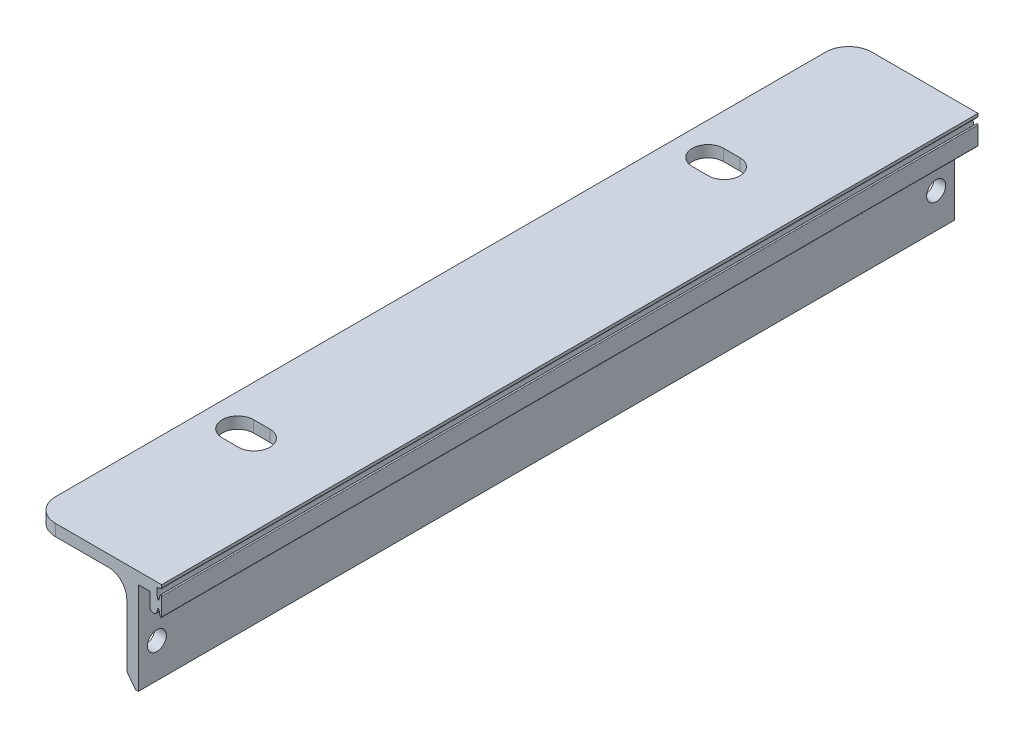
ISO-10303-21;
HEADER;
FILE_DESCRIPTION(('STEP AP214'),'2;1');
FILE_NAME('part.step','',(''),(''),'','','');
FILE_SCHEMA(('AUTOMOTIVE_DESIGN { 1 0 10303 214 1 1 1 1 }'));
ENDSEC;
DATA;
#1=APPLICATION_CONTEXT('core data for automotive mechanical design processes');
#2=APPLICATION_PROTOCOL_DEFINITION('international standard','automotive_design',2000,#1);
#3=PRODUCT_CONTEXT('',#1,'mechanical');
#4=PRODUCT('Part','Part','',(#3));
#5=PRODUCT_RELATED_PRODUCT_CATEGORY('part','',(#4));
#6=PRODUCT_DEFINITION_FORMATION('','',#4);
#7=PRODUCT_DEFINITION_CONTEXT('part definition',#1,'design');
#8=PRODUCT_DEFINITION('design','',#6,#7);
#9=PRODUCT_DEFINITION_SHAPE('','',#8);
#10=(LENGTH_UNIT() NAMED_UNIT(*) SI_UNIT(.MILLI.,.METRE.));
#11=(NAMED_UNIT(*) PLANE_ANGLE_UNIT() SI_UNIT($,.RADIAN.));
#12=(NAMED_UNIT(*) SI_UNIT($,.STERADIAN.) SOLID_ANGLE_UNIT());
#13=UNCERTAINTY_MEASURE_WITH_UNIT(LENGTH_MEASURE(1.E-05),#10,'distance_accuracy_value','');
#14=(GEOMETRIC_REPRESENTATION_CONTEXT(3) GLOBAL_UNCERTAINTY_ASSIGNED_CONTEXT((#13)) GLOBAL_UNIT_ASSIGNED_CONTEXT((#10,
#11,#12)) REPRESENTATION_CONTEXT('',''));
#15=CARTESIAN_POINT('',(0.,0.,0.));
#16=DIRECTION('',(0.,0.,1.));
#17=DIRECTION('',(1.,0.,0.));
#18=AXIS2_PLACEMENT_3D('',#15,#16,#17);
#19=CARTESIAN_POINT('',(2329.98403514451,-3290.10376988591,88.225));
#20=DIRECTION('',(1.,0.,0.));
#21=DIRECTION('',(0.,0.,-1.));
#22=AXIS2_PLACEMENT_3D('',#19,#20,#21);
#23=PLANE('',#22);
#24=DIRECTION('',(0.,0.,-1.));
#25=VECTOR('',#24,1.);
#26=CARTESIAN_POINT('',(2329.98403514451,-3290.10376988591,88.225));
#27=LINE('',#26,#25);
#28=CARTESIAN_POINT('',(2329.98403514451,-3290.10376988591,83.225));
#29=VERTEX_POINT('',#28);
#30=CARTESIAN_POINT('',(2329.98403514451,-3290.10376988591,-83.225));
#31=VERTEX_POINT('',#30);
#32=EDGE_CURVE('E381',#29,#31,#27,.T.);
#33=ORIENTED_EDGE('',*,*,#32,.T.);
#34=DIRECTION('',(0.,-1.,0.));
#35=VECTOR('',#34,1.);
#36=CARTESIAN_POINT('',(2329.98403514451,-3290.10376988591,-83.225));
#37=LINE('',#36,#35);
#38=CARTESIAN_POINT('',(2329.98403514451,-3292.60376988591,-83.225));
#39=VERTEX_POINT('',#38);
#40=EDGE_CURVE('E500',#31,#39,#37,.T.);
#41=ORIENTED_EDGE('',*,*,#40,.T.);
#42=DIRECTION('',(0.,0.,-1.));
#43=VECTOR('',#42,1.);
#44=CARTESIAN_POINT('',(2329.98403514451,-3292.60376988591,88.225));
#45=LINE('',#44,#43);
#46=CARTESIAN_POINT('',(2329.98403514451,-3292.60376988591,83.225));
#47=VERTEX_POINT('',#46);
#48=EDGE_CURVE('E487',#47,#39,#45,.T.);
#49=ORIENTED_EDGE('',*,*,#48,.F.);
#50=DIRECTION('',(0.,-1.,0.));
#51=VECTOR('',#50,1.);
#52=CARTESIAN_POINT('',(2329.98403514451,-3290.10376988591,83.225));
#53=LINE('',#52,#51);
#54=EDGE_CURVE('E490',#47,#29,#53,.F.);
#55=ORIENTED_EDGE('',*,*,#54,.T.);
#56=EDGE_LOOP('',(#33,#41,#49,#55));
#57=FACE_BOUND('',#56,.T.);
#58=ADVANCED_FACE('F37',(#57),#23,.F.);
#59=CARTESIAN_POINT('',(2329.98403514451,-3292.60376988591,88.225));
#60=DIRECTION('',(0.,1.,0.));
#61=DIRECTION('',(0.,0.,1.));
#62=AXIS2_PLACEMENT_3D('',#59,#60,#61);
#63=PLANE('',#62);
#64=DIRECTION('',(1.,0.,0.));
#65=VECTOR('',#64,1.);
#66=CARTESIAN_POINT('',(2329.98403514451,-3292.60376988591,54.1999999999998));
#67=LINE('',#66,#65);
#68=CARTESIAN_POINT('',(2336.98403514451,-3292.60376988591,54.1999999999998));
#69=VERTEX_POINT('',#68);
#70=CARTESIAN_POINT('',(2340.48403514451,-3292.60376988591,54.1999999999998));
#71=VERTEX_POINT('',#70);
#72=EDGE_CURVE('E296',#69,#71,#67,.T.);
#73=ORIENTED_EDGE('',*,*,#72,.T.);
#74=CARTESIAN_POINT('',(2340.48403514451,-3292.60376988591,50.8));
#75=DIRECTION('',(0.,1.,0.));
#76=DIRECTION('',(0.,0.,1.));
#77=AXIS2_PLACEMENT_3D('',#74,#75,#76);
#78=CIRCLE('',#77,3.39999999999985);
#79=CARTESIAN_POINT('',(2340.48403514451,-3292.60376988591,47.4000000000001));
#80=VERTEX_POINT('',#79);
#81=EDGE_CURVE('E299',#71,#80,#78,.T.);
#82=ORIENTED_EDGE('',*,*,#81,.T.);
#83=DIRECTION('',(-1.,0.,0.));
#84=VECTOR('',#83,1.);
#85=CARTESIAN_POINT('',(2329.98403514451,-3292.60376988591,47.4000000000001));
#86=LINE('',#85,#84);
#87=CARTESIAN_POINT('',(2336.98403514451,-3292.60376988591,47.4000000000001));
#88=VERTEX_POINT('',#87);
#89=EDGE_CURVE('E291',#80,#88,#86,.T.);
#90=ORIENTED_EDGE('',*,*,#89,.T.);
#91=CARTESIAN_POINT('',(2336.98403514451,-3292.60376988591,50.8));
#92=DIRECTION('',(0.,1.,0.));
#93=DIRECTION('',(0.,0.,1.));
#94=AXIS2_PLACEMENT_3D('',#91,#92,#93);
#95=CIRCLE('',#94,3.39999999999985);
#96=EDGE_CURVE('E266',#88,#69,#95,.T.);
#97=ORIENTED_EDGE('',*,*,#96,.T.);
#98=EDGE_LOOP('',(#73,#82,#90,#97));
#99=FACE_BOUND('',#98,.T.);
#100=DIRECTION('',(-1.,0.,0.));
#101=VECTOR('',#100,1.);
#102=CARTESIAN_POINT('',(2329.98403514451,-3292.60376988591,-54.1999999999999));
#103=LINE('',#102,#101);
#104=CARTESIAN_POINT('',(2340.48403514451,-3292.60376988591,-54.1999999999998));
#105=VERTEX_POINT('',#104);
#106=CARTESIAN_POINT('',(2336.98403514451,-3292.60376988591,-54.1999999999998));
#107=VERTEX_POINT('',#106);
#108=EDGE_CURVE('E328',#105,#107,#103,.T.);
#109=ORIENTED_EDGE('',*,*,#108,.T.);
#110=CARTESIAN_POINT('',(2336.98403514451,-3292.60376988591,-50.8));
#111=DIRECTION('',(0.,1.,0.));
#112=DIRECTION('',(0.,0.,1.));
#113=AXIS2_PLACEMENT_3D('',#110,#111,#112);
#114=CIRCLE('',#113,3.39999999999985);
#115=CARTESIAN_POINT('',(2336.98403514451,-3292.60376988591,-47.4000000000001));
#116=VERTEX_POINT('',#115);
#117=EDGE_CURVE('E331',#107,#116,#114,.T.);
#118=ORIENTED_EDGE('',*,*,#117,.T.);
#119=DIRECTION('',(1.,0.,0.));
#120=VECTOR('',#119,1.);
#121=CARTESIAN_POINT('',(2329.98403514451,-3292.60376988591,-47.4000000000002));
#122=LINE('',#121,#120);
#123=CARTESIAN_POINT('',(2340.48403514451,-3292.60376988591,-47.4000000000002));
#124=VERTEX_POINT('',#123);
#125=EDGE_CURVE('E316',#116,#124,#122,.T.);
#126=ORIENTED_EDGE('',*,*,#125,.T.);
#127=CARTESIAN_POINT('',(2340.48403514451,-3292.60376988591,-50.8));
#128=DIRECTION('',(0.,1.,0.));
#129=DIRECTION('',(0.,0.,1.));
#130=AXIS2_PLACEMENT_3D('',#127,#128,#129);
#131=CIRCLE('',#130,3.39999999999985);
#132=EDGE_CURVE('E325',#124,#105,#131,.T.);
#133=ORIENTED_EDGE('',*,*,#132,.T.);
#134=EDGE_LOOP('',(#109,#118,#126,#133));
#135=FACE_BOUND('',#134,.T.);
#136=DIRECTION('',(1.,0.,0.));
#137=VECTOR('',#136,1.);
#138=CARTESIAN_POINT('',(2329.98403514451,-3292.60376988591,-88.225));
#139=LINE('',#138,#137);
#140=CARTESIAN_POINT('',(2334.98403514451,-3292.60376988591,-88.225));
#141=VERTEX_POINT('',#140);
#142=CARTESIAN_POINT('',(2346.3840351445,-3292.60376988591,-88.225));
#143=VERTEX_POINT('',#142);
#144=EDGE_CURVE('E334',#141,#143,#139,.T.);
#145=ORIENTED_EDGE('',*,*,#144,.T.);
#146=DIRECTION('',(0.,0.,-1.));
#147=VECTOR('',#146,1.);
#148=CARTESIAN_POINT('',(2346.3840351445,-3292.60376988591,88.225));
#149=LINE('',#148,#147);
#150=CARTESIAN_POINT('',(2346.3840351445,-3292.60376988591,88.225));
#151=VERTEX_POINT('',#150);
#152=EDGE_CURVE('E52',#143,#151,#149,.F.);
#153=ORIENTED_EDGE('',*,*,#152,.T.);
#154=DIRECTION('',(1.,0.,0.));
#155=VECTOR('',#154,1.);
#156=CARTESIAN_POINT('',(2329.98403514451,-3292.60376988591,88.225));
#157=LINE('',#156,#155);
#158=CARTESIAN_POINT('',(2334.98403514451,-3292.60376988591,88.225));
#159=VERTEX_POINT('',#158);
#160=EDGE_CURVE('E335',#159,#151,#157,.T.);
#161=ORIENTED_EDGE('',*,*,#160,.F.);
#162=CARTESIAN_POINT('',(2334.98403514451,-3292.60376988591,83.225));
#163=DIRECTION('',(0.,1.,0.));
#164=DIRECTION('',(0.,0.,1.));
#165=AXIS2_PLACEMENT_3D('',#162,#163,#164);
#166=CIRCLE('',#165,5.);
#167=EDGE_CURVE('E503',#159,#47,#166,.F.);
#168=ORIENTED_EDGE('',*,*,#167,.T.);
#169=ORIENTED_EDGE('',*,*,#48,.T.);
#170=CARTESIAN_POINT('',(2334.98403514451,-3292.60376988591,-83.225));
#171=DIRECTION('',(0.,1.,0.));
#172=DIRECTION('',(0.,0.,1.));
#173=AXIS2_PLACEMENT_3D('',#170,#171,#172);
#174=CIRCLE('',#173,5.);
#175=EDGE_CURVE('E505',#39,#141,#174,.F.);
#176=ORIENTED_EDGE('',*,*,#175,.T.);
#177=EDGE_LOOP('',(#145,#153,#161,#168,#169,#176));
#178=FACE_BOUND('',#177,.T.);
#179=ADVANCED_FACE('F550',(#99,#135,#178),#63,.F.);
#180=CARTESIAN_POINT('',(2350.3840351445,-3292.60376988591,88.225));
#181=DIRECTION('',(1.,0.,0.));
#182=DIRECTION('',(0.,0.,-1.));
#183=AXIS2_PLACEMENT_3D('',#180,#181,#182);
#184=PLANE('',#183);
#185=CARTESIAN_POINT('',(2350.38403514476,-3305.10376988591,84.225));
#186=DIRECTION('',(-1.,0.,0.));
#187=DIRECTION('',(0.,1.,0.));
#188=AXIS2_PLACEMENT_3D('',#185,#186,#187);
#189=CIRCLE('',#188,2.0499999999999);
#190=CARTESIAN_POINT('',(2350.38403514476,-3307.15376988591,84.225));
#191=VERTEX_POINT('',#190);
#192=EDGE_CURVE('E498',#191,#191,#189,.T.);
#193=ORIENTED_EDGE('',*,*,#192,.F.);
#194=EDGE_LOOP('',(#193));
#195=FACE_BOUND('',#194,.T.);
#196=CARTESIAN_POINT('',(2350.38403514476,-3305.10376988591,-84.225));
#197=DIRECTION('',(-1.,0.,0.));
#198=DIRECTION('',(0.,-1.,0.));
#199=AXIS2_PLACEMENT_3D('',#196,#197,#198);
#200=CIRCLE('',#199,2.0499999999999);
#201=CARTESIAN_POINT('',(2350.38403514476,-3307.15376988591,-84.225));
#202=VERTEX_POINT('',#201);
#203=EDGE_CURVE('E494',#202,#202,#200,.T.);
#204=ORIENTED_EDGE('',*,*,#203,.F.);
#205=EDGE_LOOP('',(#204));
#206=FACE_BOUND('',#205,.T.);
#207=DIRECTION('',(0.,-1.,0.));
#208=VECTOR('',#207,1.);
#209=CARTESIAN_POINT('',(2350.3840351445,-3292.60376988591,88.225));
#210=LINE('',#209,#208);
#211=CARTESIAN_POINT('',(2350.3840351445,-3296.60376988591,88.225));
#212=VERTEX_POINT('',#211);
#213=CARTESIAN_POINT('',(2350.3840351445,-3310.10376988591,88.225));
#214=VERTEX_POINT('',#213);
#215=EDGE_CURVE('E337',#212,#214,#210,.T.);
#216=ORIENTED_EDGE('',*,*,#215,.F.);
#217=DIRECTION('',(0.,0.,-1.));
#218=VECTOR('',#217,1.);
#219=CARTESIAN_POINT('',(2350.3840351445,-3296.60376988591,-88.225));
#220=LINE('',#219,#218);
#221=CARTESIAN_POINT('',(2350.3840351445,-3296.60376988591,-88.225));
#222=VERTEX_POINT('',#221);
#223=EDGE_CURVE('E516',#212,#222,#220,.T.);
#224=ORIENTED_EDGE('',*,*,#223,.T.);
#225=DIRECTION('',(0.,-1.,0.));
#226=VECTOR('',#225,1.);
#227=CARTESIAN_POINT('',(2350.3840351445,-3292.60376988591,-88.225));
#228=LINE('',#227,#226);
#229=CARTESIAN_POINT('',(2350.3840351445,-3310.10376988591,-88.225));
#230=VERTEX_POINT('',#229);
#231=EDGE_CURVE('E383',#222,#230,#228,.T.);
#232=ORIENTED_EDGE('',*,*,#231,.T.);
#233=DIRECTION('',(0.,0.,-1.));
#234=VECTOR('',#233,1.);
#235=CARTESIAN_POINT('',(2350.3840351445,-3310.10376988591,88.225));
#236=LINE('',#235,#234);
#237=EDGE_CURVE('E484',#214,#230,#236,.T.);
#238=ORIENTED_EDGE('',*,*,#237,.F.);
#239=EDGE_LOOP('',(#216,#224,#232,#238));
#240=FACE_BOUND('',#239,.T.);
#241=ADVANCED_FACE('F522',(#195,#206,#240),#184,.F.);
#242=CARTESIAN_POINT('',(2350.3840351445,-3310.10376988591,88.225));
#243=DIRECTION('',(0.796162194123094,0.605083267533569,0.));
#244=DIRECTION('',(-0.605083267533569,0.796162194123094,0.));
#245=AXIS2_PLACEMENT_3D('',#242,#243,#244);
#246=PLANE('',#245);
#247=DIRECTION('',(0.605083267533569,-0.796162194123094,0.));
#248=VECTOR('',#247,1.);
#249=CARTESIAN_POINT('',(2350.3840351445,-3310.10376988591,-88.225));
#250=LINE('',#249,#248);
#251=CARTESIAN_POINT('',(2352.2840351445,-3312.60376988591,-88.225));
#252=VERTEX_POINT('',#251);
#253=EDGE_CURVE('E385',#230,#252,#250,.T.);
#254=ORIENTED_EDGE('',*,*,#253,.T.);
#255=DIRECTION('',(0.,0.,-1.));
#256=VECTOR('',#255,1.);
#257=CARTESIAN_POINT('',(2352.2840351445,-3312.60376988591,88.225));
#258=LINE('',#257,#256);
#259=CARTESIAN_POINT('',(2352.2840351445,-3312.60376988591,88.225));
#260=VERTEX_POINT('',#259);
#261=EDGE_CURVE('E481',#260,#252,#258,.T.);
#262=ORIENTED_EDGE('',*,*,#261,.F.);
#263=DIRECTION('',(0.605083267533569,-0.796162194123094,0.));
#264=VECTOR('',#263,1.);
#265=CARTESIAN_POINT('',(2350.3840351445,-3310.10376988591,88.225));
#266=LINE('',#265,#264);
#267=EDGE_CURVE('E340',#214,#260,#266,.T.);
#268=ORIENTED_EDGE('',*,*,#267,.F.);
#269=ORIENTED_EDGE('',*,*,#237,.T.);
#270=EDGE_LOOP('',(#254,#262,#268,#269));
#271=FACE_BOUND('',#270,.T.);
#272=ADVANCED_FACE('F532',(#271),#246,.F.);
#273=CARTESIAN_POINT('',(2352.8840351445,-3312.60376988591,88.225));
#274=DIRECTION('',(0.,1.,0.));
#275=DIRECTION('',(0.,0.,1.));
#276=AXIS2_PLACEMENT_3D('',#273,#274,#275);
#277=PLANE('',#276);
#278=DIRECTION('',(1.,0.,0.));
#279=VECTOR('',#278,1.);
#280=CARTESIAN_POINT('',(2352.8840351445,-3312.60376988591,-88.225));
#281=LINE('',#280,#279);
#282=CARTESIAN_POINT('',(2352.8840351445,-3312.60376988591,-88.225));
#283=VERTEX_POINT('',#282);
#284=EDGE_CURVE('E387',#252,#283,#281,.T.);
#285=ORIENTED_EDGE('',*,*,#284,.T.);
#286=DIRECTION('',(0.,0.,-1.));
#287=VECTOR('',#286,1.);
#288=CARTESIAN_POINT('',(2352.8840351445,-3312.60376988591,88.225));
#289=LINE('',#288,#287);
#290=CARTESIAN_POINT('',(2352.8840351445,-3312.60376988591,88.225));
#291=VERTEX_POINT('',#290);
#292=EDGE_CURVE('E478',#291,#283,#289,.T.);
#293=ORIENTED_EDGE('',*,*,#292,.F.);
#294=DIRECTION('',(1.,0.,0.));
#295=VECTOR('',#294,1.);
#296=CARTESIAN_POINT('',(2352.8840351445,-3312.60376988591,88.225));
#297=LINE('',#296,#295);
#298=EDGE_CURVE('E342',#260,#291,#297,.T.);
#299=ORIENTED_EDGE('',*,*,#298,.F.);
#300=ORIENTED_EDGE('',*,*,#261,.T.);
#301=EDGE_LOOP('',(#285,#293,#299,#300));
#302=FACE_BOUND('',#301,.T.);
#303=ADVANCED_FACE('F536',(#302),#277,.F.);
#304=CARTESIAN_POINT('',(2352.88403514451,-3292.60376988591,88.225));
#305=DIRECTION('',(-1.,0.,0.));
#306=DIRECTION('',(0.,-1.,0.));
#307=AXIS2_PLACEMENT_3D('',#304,#305,#306);
#308=PLANE('',#307);
#309=CARTESIAN_POINT('',(2352.88403514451,-3305.10376988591,84.225));
#310=DIRECTION('',(-1.,0.,0.));
#311=DIRECTION('',(0.,-1.,0.));
#312=AXIS2_PLACEMENT_3D('',#309,#310,#311);
#313=CIRCLE('',#312,2.0499999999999);
#314=CARTESIAN_POINT('',(2352.88403514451,-3307.15376988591,84.225));
#315=VERTEX_POINT('',#314);
#316=EDGE_CURVE('E495',#315,#315,#313,.T.);
#317=ORIENTED_EDGE('',*,*,#316,.T.);
#318=EDGE_LOOP('',(#317));
#319=FACE_BOUND('',#318,.T.);
#320=CARTESIAN_POINT('',(2352.88403514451,-3305.10376988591,-84.225));
#321=DIRECTION('',(-1.,0.,0.));
#322=DIRECTION('',(0.,-1.,0.));
#323=AXIS2_PLACEMENT_3D('',#320,#321,#322);
#324=CIRCLE('',#323,2.0499999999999);
#325=CARTESIAN_POINT('',(2352.88403514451,-3307.15376988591,-84.225));
#326=VERTEX_POINT('',#325);
#327=EDGE_CURVE('E491',#326,#326,#324,.T.);
#328=ORIENTED_EDGE('',*,*,#327,.T.);
#329=EDGE_LOOP('',(#328));
#330=FACE_BOUND('',#329,.T.);
#331=DIRECTION('',(0.,1.,0.));
#332=VECTOR('',#331,1.);
#333=CARTESIAN_POINT('',(2352.88403514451,-3292.60376988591,-88.225));
#334=LINE('',#333,#332);
#335=CARTESIAN_POINT('',(2352.88403514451,-3292.60376988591,-88.225));
#336=VERTEX_POINT('',#335);
#337=EDGE_CURVE('E389',#283,#336,#334,.T.);
#338=ORIENTED_EDGE('',*,*,#337,.T.);
#339=DIRECTION('',(0.,0.,-1.));
#340=VECTOR('',#339,1.);
#341=CARTESIAN_POINT('',(2352.88403514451,-3292.60376988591,88.225));
#342=LINE('',#341,#340);
#343=CARTESIAN_POINT('',(2352.88403514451,-3292.60376988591,88.225));
#344=VERTEX_POINT('',#343);
#345=EDGE_CURVE('E475',#344,#336,#342,.T.);
#346=ORIENTED_EDGE('',*,*,#345,.F.);
#347=DIRECTION('',(0.,1.,0.));
#348=VECTOR('',#347,1.);
#349=CARTESIAN_POINT('',(2352.88403514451,-3292.60376988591,88.225));
#350=LINE('',#349,#348);
#351=EDGE_CURVE('E344',#291,#344,#350,.T.);
#352=ORIENTED_EDGE('',*,*,#351,.F.);
#353=ORIENTED_EDGE('',*,*,#292,.T.);
#354=EDGE_LOOP('',(#338,#346,#352,#353));
#355=FACE_BOUND('',#354,.T.);
#356=ADVANCED_FACE('F661',(#319,#330,#355),#308,.F.);
#357=CARTESIAN_POINT('',(2352.88403514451,-3292.60376988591,88.225));
#358=DIRECTION('',(3.55271367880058E-13,1.,0.));
#359=DIRECTION('',(-1.,3.55271367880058E-13,0.));
#360=AXIS2_PLACEMENT_3D('',#357,#358,#359);
#361=PLANE('',#360);
#362=DIRECTION('',(1.,-3.55271367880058E-13,0.));
#363=VECTOR('',#362,1.);
#364=CARTESIAN_POINT('',(2352.88403514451,-3292.60376988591,-88.225));
#365=LINE('',#364,#363);
#366=CARTESIAN_POINT('',(2355.38403514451,-3292.60376988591,-88.225));
#367=VERTEX_POINT('',#366);
#368=EDGE_CURVE('E391',#336,#367,#365,.T.);
#369=ORIENTED_EDGE('',*,*,#368,.T.);
#370=DIRECTION('',(0.,0.,-1.));
#371=VECTOR('',#370,1.);
#372=CARTESIAN_POINT('',(2355.38403514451,-3292.60376988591,88.225));
#373=LINE('',#372,#371);
#374=CARTESIAN_POINT('',(2355.38403514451,-3292.60376988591,88.225));
#375=VERTEX_POINT('',#374);
#376=EDGE_CURVE('E472',#375,#367,#373,.T.);
#377=ORIENTED_EDGE('',*,*,#376,.F.);
#378=DIRECTION('',(1.,-3.55271367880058E-13,0.));
#379=VECTOR('',#378,1.);
#380=CARTESIAN_POINT('',(2352.88403514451,-3292.60376988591,88.225));
#381=LINE('',#380,#379);
#382=EDGE_CURVE('E346',#344,#375,#381,.T.);
#383=ORIENTED_EDGE('',*,*,#382,.F.);
#384=ORIENTED_EDGE('',*,*,#345,.T.);
#385=EDGE_LOOP('',(#369,#377,#383,#384));
#386=FACE_BOUND('',#385,.T.);
#387=ADVANCED_FACE('F659',(#386),#361,.F.);
#388=CARTESIAN_POINT('',(2355.38403514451,-3292.60376988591,88.225));
#389=DIRECTION('',(1.,4.56766335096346E-13,0.));
#390=DIRECTION('',(-4.56766335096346E-13,1.,0.));
#391=AXIS2_PLACEMENT_3D('',#388,#389,#390);
#392=PLANE('',#391);
#393=DIRECTION('',(4.56766335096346E-13,-1.,0.));
#394=VECTOR('',#393,1.);
#395=CARTESIAN_POINT('',(2355.38403514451,-3292.60376988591,-88.225));
#396=LINE('',#395,#394);
#397=CARTESIAN_POINT('',(2355.38403514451,-3295.52050767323,-88.225));
#398=VERTEX_POINT('',#397);
#399=EDGE_CURVE('E393',#367,#398,#396,.T.);
#400=ORIENTED_EDGE('',*,*,#399,.T.);
#401=DIRECTION('',(0.,0.,-1.));
#402=VECTOR('',#401,1.);
#403=CARTESIAN_POINT('',(2355.38403514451,-3295.52050767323,88.225));
#404=LINE('',#403,#402);
#405=CARTESIAN_POINT('',(2355.38403514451,-3295.52050767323,88.225));
#406=VERTEX_POINT('',#405);
#407=EDGE_CURVE('E469',#406,#398,#404,.T.);
#408=ORIENTED_EDGE('',*,*,#407,.F.);
#409=DIRECTION('',(4.56766335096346E-13,-1.,0.));
#410=VECTOR('',#409,1.);
#411=CARTESIAN_POINT('',(2355.38403514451,-3292.60376988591,88.225));
#412=LINE('',#411,#410);
#413=EDGE_CURVE('E348',#375,#406,#412,.T.);
#414=ORIENTED_EDGE('',*,*,#413,.F.);
#415=ORIENTED_EDGE('',*,*,#376,.T.);
#416=EDGE_LOOP('',(#400,#408,#414,#415));
#417=FACE_BOUND('',#416,.T.);
#418=ADVANCED_FACE('F655',(#417),#392,.F.);
#419=CARTESIAN_POINT('',(2356.16707703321,-3295.52050767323,88.225));
#420=DIRECTION('',(0.,0.,-1.));
#421=DIRECTION('',(-1.,0.,0.));
#422=AXIS2_PLACEMENT_3D('',#419,#420,#421);
#423=CYLINDRICAL_SURFACE('',#422,0.783041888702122);
#424=CARTESIAN_POINT('',(2356.16707703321,-3295.52050767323,-88.225));
#425=DIRECTION('',(0.,0.,1.));
#426=DIRECTION('',(1.,0.,0.));
#427=AXIS2_PLACEMENT_3D('',#424,#425,#426);
#428=CIRCLE('',#427,0.783041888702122);
#429=CARTESIAN_POINT('',(2356.93315007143,-3295.68263940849,-88.225));
#430=VERTEX_POINT('',#429);
#431=EDGE_CURVE('E395',#398,#430,#428,.T.);
#432=ORIENTED_EDGE('',*,*,#431,.T.);
#433=DIRECTION('',(0.,0.,-1.));
#434=VECTOR('',#433,1.);
#435=CARTESIAN_POINT('',(2356.93315007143,-3295.68263940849,88.225));
#436=LINE('',#435,#434);
#437=CARTESIAN_POINT('',(2356.93315007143,-3295.68263940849,88.225));
#438=VERTEX_POINT('',#437);
#439=EDGE_CURVE('E466',#438,#430,#436,.T.);
#440=ORIENTED_EDGE('',*,*,#439,.F.);
#441=CARTESIAN_POINT('',(2356.16707703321,-3295.52050767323,88.225));
#442=DIRECTION('',(0.,0.,1.));
#443=DIRECTION('',(1.,0.,0.));
#444=AXIS2_PLACEMENT_3D('',#441,#442,#443);
#445=CIRCLE('',#444,0.783041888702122);
#446=EDGE_CURVE('E350',#406,#438,#445,.T.);
#447=ORIENTED_EDGE('',*,*,#446,.F.);
#448=ORIENTED_EDGE('',*,*,#407,.T.);
#449=EDGE_LOOP('',(#432,#440,#447,#448));
#450=FACE_BOUND('',#449,.T.);
#451=ADVANCED_FACE('F650',(#450),#423,.T.);
#452=CARTESIAN_POINT('',(2356.93315007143,-3295.68263940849,88.225));
#453=DIRECTION('',(-0.978329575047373,0.207053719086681,0.));
#454=DIRECTION('',(-0.207053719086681,-0.978329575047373,0.));
#455=AXIS2_PLACEMENT_3D('',#452,#453,#454);
#456=PLANE('',#455);
#457=DIRECTION('',(0.207053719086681,0.978329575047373,0.));
#458=VECTOR('',#457,1.);
#459=CARTESIAN_POINT('',(2356.93315007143,-3295.68263940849,-88.225));
#460=LINE('',#459,#458);
#461=CARTESIAN_POINT('',(2357.0657770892,-3295.05597626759,-88.225));
#462=VERTEX_POINT('',#461);
#463=EDGE_CURVE('E397',#430,#462,#460,.T.);
#464=ORIENTED_EDGE('',*,*,#463,.T.);
#465=DIRECTION('',(0.,0.,-1.));
#466=VECTOR('',#465,1.);
#467=CARTESIAN_POINT('',(2357.0657770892,-3295.05597626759,88.225));
#468=LINE('',#467,#466);
#469=CARTESIAN_POINT('',(2357.0657770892,-3295.05597626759,88.225));
#470=VERTEX_POINT('',#469);
#471=EDGE_CURVE('E463',#470,#462,#468,.T.);
#472=ORIENTED_EDGE('',*,*,#471,.F.);
#473=DIRECTION('',(0.207053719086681,0.978329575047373,0.));
#474=VECTOR('',#473,1.);
#475=CARTESIAN_POINT('',(2356.93315007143,-3295.68263940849,88.225));
#476=LINE('',#475,#474);
#477=EDGE_CURVE('E352',#438,#470,#476,.T.);
#478=ORIENTED_EDGE('',*,*,#477,.F.);
#479=ORIENTED_EDGE('',*,*,#439,.T.);
#480=EDGE_LOOP('',(#464,#472,#478,#479));
#481=FACE_BOUND('',#480,.T.);
#482=ADVANCED_FACE('F644',(#481),#456,.F.);
#483=CARTESIAN_POINT('',(2357.21403514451,-3295.07876988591,88.225));
#484=DIRECTION('',(0.,0.,-1.));
#485=DIRECTION('',(-1.,0.,0.));
#486=AXIS2_PLACEMENT_3D('',#483,#484,#485);
#487=CYLINDRICAL_SURFACE('',#486,0.149999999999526);
#488=CARTESIAN_POINT('',(2357.21403514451,-3295.07876988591,-88.225));
#489=DIRECTION('',(0.,0.,-1.));
#490=DIRECTION('',(1.,0.,0.));
#491=AXIS2_PLACEMENT_3D('',#488,#489,#490);
#492=CIRCLE('',#491,0.149999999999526);
#493=CARTESIAN_POINT('',(2357.36106233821,-3295.04905449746,-88.225));
#494=VERTEX_POINT('',#493);
#495=EDGE_CURVE('E399',#462,#494,#492,.T.);
#496=ORIENTED_EDGE('',*,*,#495,.T.);
#497=DIRECTION('',(0.,0.,-1.));
#498=VECTOR('',#497,1.);
#499=CARTESIAN_POINT('',(2357.36106233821,-3295.04905449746,88.225));
#500=LINE('',#499,#498);
#501=CARTESIAN_POINT('',(2357.36106233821,-3295.04905449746,88.225));
#502=VERTEX_POINT('',#501);
#503=EDGE_CURVE('E460',#502,#494,#500,.T.);
#504=ORIENTED_EDGE('',*,*,#503,.F.);
#505=CARTESIAN_POINT('',(2357.21403514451,-3295.07876988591,88.225));
#506=DIRECTION('',(0.,0.,-1.));
#507=DIRECTION('',(1.,0.,0.));
#508=AXIS2_PLACEMENT_3D('',#505,#506,#507);
#509=CIRCLE('',#508,0.149999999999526);
#510=EDGE_CURVE('E354',#470,#502,#509,.T.);
#511=ORIENTED_EDGE('',*,*,#510,.F.);
#512=ORIENTED_EDGE('',*,*,#471,.T.);
#513=EDGE_LOOP('',(#496,#504,#511,#512));
#514=FACE_BOUND('',#513,.T.);
#515=ADVANCED_FACE('F640',(#514),#487,.F.);
#516=CARTESIAN_POINT('',(2357.36106233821,-3295.04905449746,88.225));
#517=DIRECTION('',(0.980181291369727,0.198102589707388,0.));
#518=DIRECTION('',(-0.198102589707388,0.980181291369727,0.));
#519=AXIS2_PLACEMENT_3D('',#516,#517,#518);
#520=PLANE('',#519);
#521=DIRECTION('',(0.198102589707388,-0.980181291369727,0.));
#522=VECTOR('',#521,1.);
#523=CARTESIAN_POINT('',(2357.36106233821,-3295.04905449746,-88.225));
#524=LINE('',#523,#522);
#525=CARTESIAN_POINT('',(2357.58727718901,-3296.16833095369,-88.225));
#526=VERTEX_POINT('',#525);
#527=EDGE_CURVE('E401',#494,#526,#524,.T.);
#528=ORIENTED_EDGE('',*,*,#527,.T.);
#529=DIRECTION('',(0.,0.,-1.));
#530=VECTOR('',#529,1.);
#531=CARTESIAN_POINT('',(2357.58727718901,-3296.16833095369,88.225));
#532=LINE('',#531,#530);
#533=CARTESIAN_POINT('',(2357.58727718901,-3296.16833095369,88.225));
#534=VERTEX_POINT('',#533);
#535=EDGE_CURVE('E457',#534,#526,#532,.T.);
#536=ORIENTED_EDGE('',*,*,#535,.F.);
#537=DIRECTION('',(0.198102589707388,-0.980181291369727,0.));
#538=VECTOR('',#537,1.);
#539=CARTESIAN_POINT('',(2357.36106233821,-3295.04905449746,88.225));
#540=LINE('',#539,#538);
#541=EDGE_CURVE('E356',#502,#534,#540,.T.);
#542=ORIENTED_EDGE('',*,*,#541,.F.);
#543=ORIENTED_EDGE('',*,*,#503,.T.);
#544=EDGE_LOOP('',(#528,#536,#542,#543));
#545=FACE_BOUND('',#544,.T.);
#546=ADVANCED_FACE('F635',(#545),#520,.F.);
#547=CARTESIAN_POINT('',(2357.75403514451,-3296.13462781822,88.225));
#548=DIRECTION('',(0.,0.,-1.));
#549=DIRECTION('',(-1.,0.,0.));
#550=AXIS2_PLACEMENT_3D('',#547,#548,#549);
#551=CYLINDRICAL_SURFACE('',#550,0.170129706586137);
#552=CARTESIAN_POINT('',(2357.75403514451,-3296.13462781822,-88.225));
#553=DIRECTION('',(0.,0.,1.));
#554=DIRECTION('',(1.,0.,0.));
#555=AXIS2_PLACEMENT_3D('',#552,#553,#554);
#556=CIRCLE('',#555,0.170129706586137);
#557=CARTESIAN_POINT('',(2357.92403514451,-3296.12798575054,-88.225));
#558=VERTEX_POINT('',#557);
#559=EDGE_CURVE('E403',#526,#558,#556,.T.);
#560=ORIENTED_EDGE('',*,*,#559,.T.);
#561=DIRECTION('',(0.,0.,-1.));
#562=VECTOR('',#561,1.);
#563=CARTESIAN_POINT('',(2357.92403514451,-3296.12798575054,88.225));
#564=LINE('',#563,#562);
#565=CARTESIAN_POINT('',(2357.92403514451,-3296.12798575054,88.225));
#566=VERTEX_POINT('',#565);
#567=EDGE_CURVE('E454',#566,#558,#564,.T.);
#568=ORIENTED_EDGE('',*,*,#567,.F.);
#569=CARTESIAN_POINT('',(2357.75403514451,-3296.13462781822,88.225));
#570=DIRECTION('',(0.,0.,1.));
#571=DIRECTION('',(1.,0.,0.));
#572=AXIS2_PLACEMENT_3D('',#569,#570,#571);
#573=CIRCLE('',#572,0.170129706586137);
#574=EDGE_CURVE('E358',#534,#566,#573,.T.);
#575=ORIENTED_EDGE('',*,*,#574,.F.);
#576=ORIENTED_EDGE('',*,*,#535,.T.);
#577=EDGE_LOOP('',(#560,#568,#575,#576));
#578=FACE_BOUND('',#577,.T.);
#579=ADVANCED_FACE('F629',(#578),#551,.T.);
#580=CARTESIAN_POINT('',(2357.92403514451,-3292.2795540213,88.225));
#581=DIRECTION('',(-1.,0.,0.));
#582=DIRECTION('',(0.,0.,1.));
#583=AXIS2_PLACEMENT_3D('',#580,#581,#582);
#584=PLANE('',#583);
#585=DIRECTION('',(0.,1.,0.));
#586=VECTOR('',#585,1.);
#587=CARTESIAN_POINT('',(2357.92403514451,-3292.2795540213,-88.225));
#588=LINE('',#587,#586);
#589=CARTESIAN_POINT('',(2357.92403514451,-3292.2795540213,-88.225));
#590=VERTEX_POINT('',#589);
#591=EDGE_CURVE('E405',#558,#590,#588,.T.);
#592=ORIENTED_EDGE('',*,*,#591,.T.);
#593=DIRECTION('',(0.,0.,-1.));
#594=VECTOR('',#593,1.);
#595=CARTESIAN_POINT('',(2357.92403514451,-3292.2795540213,88.225));
#596=LINE('',#595,#594);
#597=CARTESIAN_POINT('',(2357.92403514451,-3292.2795540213,88.225));
#598=VERTEX_POINT('',#597);
#599=EDGE_CURVE('E451',#598,#590,#596,.T.);
#600=ORIENTED_EDGE('',*,*,#599,.F.);
#601=DIRECTION('',(0.,1.,0.));
#602=VECTOR('',#601,1.);
#603=CARTESIAN_POINT('',(2357.92403514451,-3292.2795540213,88.225));
#604=LINE('',#603,#602);
#605=EDGE_CURVE('E360',#566,#598,#604,.T.);
#606=ORIENTED_EDGE('',*,*,#605,.F.);
#607=ORIENTED_EDGE('',*,*,#567,.T.);
#608=EDGE_LOOP('',(#592,#600,#606,#607));
#609=FACE_BOUND('',#608,.T.);
#610=ADVANCED_FACE('F625',(#609),#584,.F.);
#611=CARTESIAN_POINT('',(2357.75403514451,-3292.27291195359,88.225));
#612=DIRECTION('',(0.,0.,-1.));
#613=DIRECTION('',(-1.,0.,0.));
#614=AXIS2_PLACEMENT_3D('',#611,#612,#613);
#615=CYLINDRICAL_SURFACE('',#614,0.170129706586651);
#616=CARTESIAN_POINT('',(2357.75403514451,-3292.27291195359,-88.225));
#617=DIRECTION('',(0.,0.,1.));
#618=DIRECTION('',(1.,0.,0.));
#619=AXIS2_PLACEMENT_3D('',#616,#617,#618);
#620=CIRCLE('',#619,0.170129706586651);
#621=CARTESIAN_POINT('',(2357.58835224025,-3292.23426881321,-88.225));
#622=VERTEX_POINT('',#621);
#623=EDGE_CURVE('E407',#590,#622,#620,.T.);
#624=ORIENTED_EDGE('',*,*,#623,.T.);
#625=DIRECTION('',(0.,0.,-1.));
#626=VECTOR('',#625,1.);
#627=CARTESIAN_POINT('',(2357.58835224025,-3292.23426881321,88.225));
#628=LINE('',#627,#626);
#629=CARTESIAN_POINT('',(2357.58835224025,-3292.23426881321,88.225));
#630=VERTEX_POINT('',#629);
#631=EDGE_CURVE('E448',#630,#622,#628,.T.);
#632=ORIENTED_EDGE('',*,*,#631,.F.);
#633=CARTESIAN_POINT('',(2357.75403514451,-3292.27291195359,88.225));
#634=DIRECTION('',(0.,0.,1.));
#635=DIRECTION('',(1.,0.,0.));
#636=AXIS2_PLACEMENT_3D('',#633,#634,#635);
#637=CIRCLE('',#636,0.170129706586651);
#638=EDGE_CURVE('E362',#598,#630,#637,.T.);
#639=ORIENTED_EDGE('',*,*,#638,.F.);
#640=ORIENTED_EDGE('',*,*,#599,.T.);
#641=EDGE_LOOP('',(#624,#632,#639,#640));
#642=FACE_BOUND('',#641,.T.);
#643=ADVANCED_FACE('F620',(#642),#615,.T.);
#644=CARTESIAN_POINT('',(2357.58835224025,-3292.23426881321,88.225));
#645=DIRECTION('',(0.973862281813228,-0.227139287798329,0.));
#646=DIRECTION('',(0.227139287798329,0.973862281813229,0.));
#647=AXIS2_PLACEMENT_3D('',#644,#645,#646);
#648=PLANE('',#647);
#649=DIRECTION('',(-0.227139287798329,-0.973862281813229,0.));
#650=VECTOR('',#649,1.);
#651=CARTESIAN_POINT('',(2357.58835224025,-3292.23426881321,-88.225));
#652=LINE('',#651,#650);
#653=CARTESIAN_POINT('',(2357.36011448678,-3293.21284077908,-88.225));
#654=VERTEX_POINT('',#653);
#655=EDGE_CURVE('E409',#622,#654,#652,.T.);
#656=ORIENTED_EDGE('',*,*,#655,.T.);
#657=DIRECTION('',(0.,0.,-1.));
#658=VECTOR('',#657,1.);
#659=CARTESIAN_POINT('',(2357.36011448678,-3293.21284077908,88.225));
#660=LINE('',#659,#658);
#661=CARTESIAN_POINT('',(2357.36011448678,-3293.21284077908,88.225));
#662=VERTEX_POINT('',#661);
#663=EDGE_CURVE('E445',#662,#654,#660,.T.);
#664=ORIENTED_EDGE('',*,*,#663,.F.);
#665=DIRECTION('',(-0.227139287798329,-0.973862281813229,0.));
#666=VECTOR('',#665,1.);
#667=CARTESIAN_POINT('',(2357.58835224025,-3292.23426881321,88.225));
#668=LINE('',#667,#666);
#669=EDGE_CURVE('E364',#630,#662,#668,.T.);
#670=ORIENTED_EDGE('',*,*,#669,.F.);
#671=ORIENTED_EDGE('',*,*,#631,.T.);
#672=EDGE_LOOP('',(#656,#664,#670,#671));
#673=FACE_BOUND('',#672,.T.);
#674=ADVANCED_FACE('F614',(#673),#648,.F.);
#675=CARTESIAN_POINT('',(2357.21403514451,-3293.17876988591,88.225));
#676=DIRECTION('',(0.,0.,-1.));
#677=DIRECTION('',(-1.,0.,0.));
#678=AXIS2_PLACEMENT_3D('',#675,#676,#677);
#679=CYLINDRICAL_SURFACE('',#678,0.149999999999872);
#680=CARTESIAN_POINT('',(2357.21403514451,-3293.17876988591,-88.225));
#681=DIRECTION('',(0.,0.,-1.));
#682=DIRECTION('',(1.,0.,0.));
#683=AXIS2_PLACEMENT_3D('',#680,#681,#682);
#684=CIRCLE('',#683,0.149999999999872);
#685=CARTESIAN_POINT('',(2357.06505879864,-3293.19626412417,-88.225));
#686=VERTEX_POINT('',#685);
#687=EDGE_CURVE('E411',#654,#686,#684,.T.);
#688=ORIENTED_EDGE('',*,*,#687,.T.);
#689=DIRECTION('',(0.,0.,-1.));
#690=VECTOR('',#689,1.);
#691=CARTESIAN_POINT('',(2357.06505879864,-3293.19626412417,88.225));
#692=LINE('',#691,#690);
#693=CARTESIAN_POINT('',(2357.06505879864,-3293.19626412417,88.225));
#694=VERTEX_POINT('',#693);
#695=EDGE_CURVE('E442',#694,#686,#692,.T.);
#696=ORIENTED_EDGE('',*,*,#695,.F.);
#697=CARTESIAN_POINT('',(2357.21403514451,-3293.17876988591,88.225));
#698=DIRECTION('',(0.,0.,-1.));
#699=DIRECTION('',(1.,0.,0.));
#700=AXIS2_PLACEMENT_3D('',#697,#698,#699);
#701=CIRCLE('',#700,0.149999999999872);
#702=EDGE_CURVE('E366',#662,#694,#701,.T.);
#703=ORIENTED_EDGE('',*,*,#702,.F.);
#704=ORIENTED_EDGE('',*,*,#663,.T.);
#705=EDGE_LOOP('',(#688,#696,#703,#704));
#706=FACE_BOUND('',#705,.T.);
#707=ADVANCED_FACE('F610',(#706),#679,.F.);
#708=CARTESIAN_POINT('',(2363.3121199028,-3291.606294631,88.225));
#709=DIRECTION('',(0.,0.,-1.));
#710=DIRECTION('',(-1.,0.,0.));
#711=AXIS2_PLACEMENT_3D('',#708,#709,#710);
#712=CYLINDRICAL_SURFACE('',#711,6.44622179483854);
#713=CARTESIAN_POINT('',(2363.3121199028,-3291.606294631,-88.225));
#714=DIRECTION('',(0.,0.,-1.));
#715=DIRECTION('',(1.,0.,0.));
#716=AXIS2_PLACEMENT_3D('',#713,#714,#715);
#717=CIRCLE('',#716,6.44622179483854);
#718=CARTESIAN_POINT('',(2356.87109185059,-3291.34758038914,-88.225));
#719=VERTEX_POINT('',#718);
#720=EDGE_CURVE('E413',#686,#719,#717,.T.);
#721=ORIENTED_EDGE('',*,*,#720,.T.);
#722=DIRECTION('',(0.,0.,-1.));
#723=VECTOR('',#722,1.);
#724=CARTESIAN_POINT('',(2356.87109185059,-3291.34758038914,88.225));
#725=LINE('',#724,#723);
#726=CARTESIAN_POINT('',(2356.87109185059,-3291.34758038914,88.225));
#727=VERTEX_POINT('',#726);
#728=EDGE_CURVE('E439',#727,#719,#725,.T.);
#729=ORIENTED_EDGE('',*,*,#728,.F.);
#730=CARTESIAN_POINT('',(2363.3121199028,-3291.606294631,88.225));
#731=DIRECTION('',(0.,0.,-1.));
#732=DIRECTION('',(1.,0.,0.));
#733=AXIS2_PLACEMENT_3D('',#730,#731,#732);
#734=CIRCLE('',#733,6.44622179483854);
#735=EDGE_CURVE('E368',#694,#727,#734,.T.);
#736=ORIENTED_EDGE('',*,*,#735,.F.);
#737=ORIENTED_EDGE('',*,*,#695,.T.);
#738=EDGE_LOOP('',(#721,#729,#736,#737));
#739=FACE_BOUND('',#738,.T.);
#740=ADVANCED_FACE('F605',(#739),#712,.F.);
#741=CARTESIAN_POINT('',(2357.17085013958,-3291.35962066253,88.225));
#742=DIRECTION('',(0.,0.,-1.));
#743=DIRECTION('',(-1.,0.,0.));
#744=AXIS2_PLACEMENT_3D('',#741,#742,#743);
#745=CYLINDRICAL_SURFACE('',#744,0.29999999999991);
#746=CARTESIAN_POINT('',(2357.17085013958,-3291.35962066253,-88.225));
#747=DIRECTION('',(0.,0.,-1.));
#748=DIRECTION('',(1.,0.,0.));
#749=AXIS2_PLACEMENT_3D('',#746,#747,#748);
#750=CIRCLE('',#749,0.29999999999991);
#751=CARTESIAN_POINT('',(2357.12290306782,-3291.06347698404,-88.225));
#752=VERTEX_POINT('',#751);
#753=EDGE_CURVE('E415',#719,#752,#750,.T.);
#754=ORIENTED_EDGE('',*,*,#753,.T.);
#755=DIRECTION('',(0.,0.,-1.));
#756=VECTOR('',#755,1.);
#757=CARTESIAN_POINT('',(2357.12290306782,-3291.06347698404,88.225));
#758=LINE('',#757,#756);
#759=CARTESIAN_POINT('',(2357.12290306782,-3291.06347698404,88.225));
#760=VERTEX_POINT('',#759);
#761=EDGE_CURVE('E436',#760,#752,#758,.T.);
#762=ORIENTED_EDGE('',*,*,#761,.F.);
#763=CARTESIAN_POINT('',(2357.17085013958,-3291.35962066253,88.225));
#764=DIRECTION('',(0.,0.,-1.));
#765=DIRECTION('',(1.,0.,0.));
#766=AXIS2_PLACEMENT_3D('',#763,#764,#765);
#767=CIRCLE('',#766,0.29999999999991);
#768=EDGE_CURVE('E370',#727,#760,#767,.T.);
#769=ORIENTED_EDGE('',*,*,#768,.F.);
#770=ORIENTED_EDGE('',*,*,#728,.T.);
#771=EDGE_LOOP('',(#754,#762,#769,#770));
#772=FACE_BOUND('',#771,.T.);
#773=ADVANCED_FACE('F599',(#772),#745,.F.);
#774=CARTESIAN_POINT('',(2357.12290306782,-3291.06347698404,88.225));
#775=DIRECTION('',(-0.15982357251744,0.987145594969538,0.));
#776=DIRECTION('',(-0.987145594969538,-0.15982357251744,0.));
#777=AXIS2_PLACEMENT_3D('',#774,#775,#776);
#778=PLANE('',#777);
#779=DIRECTION('',(0.987145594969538,0.15982357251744,0.));
#780=VECTOR('',#779,1.);
#781=CARTESIAN_POINT('',(2357.12290306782,-3291.06347698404,-88.225));
#782=LINE('',#781,#780);
#783=CARTESIAN_POINT('',(2357.67198221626,-3290.97457845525,-88.225));
#784=VERTEX_POINT('',#783);
#785=EDGE_CURVE('E417',#752,#784,#782,.T.);
#786=ORIENTED_EDGE('',*,*,#785,.T.);
#787=DIRECTION('',(0.,0.,-1.));
#788=VECTOR('',#787,1.);
#789=CARTESIAN_POINT('',(2357.67198221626,-3290.97457845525,88.225));
#790=LINE('',#789,#788);
#791=CARTESIAN_POINT('',(2357.67198221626,-3290.97457845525,88.225));
#792=VERTEX_POINT('',#791);
#793=EDGE_CURVE('E433',#792,#784,#790,.T.);
#794=ORIENTED_EDGE('',*,*,#793,.F.);
#795=DIRECTION('',(0.987145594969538,0.15982357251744,0.));
#796=VECTOR('',#795,1.);
#797=CARTESIAN_POINT('',(2357.12290306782,-3291.06347698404,88.225));
#798=LINE('',#797,#796);
#799=EDGE_CURVE('E372',#760,#792,#798,.T.);
#800=ORIENTED_EDGE('',*,*,#799,.F.);
#801=ORIENTED_EDGE('',*,*,#761,.T.);
#802=EDGE_LOOP('',(#786,#794,#800,#801));
#803=FACE_BOUND('',#802,.T.);
#804=ADVANCED_FACE('F595',(#803),#778,.F.);
#805=CARTESIAN_POINT('',(2357.62403514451,-3290.67843477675,88.225));
#806=DIRECTION('',(0.,0.,-1.));
#807=DIRECTION('',(-1.,0.,0.));
#808=AXIS2_PLACEMENT_3D('',#805,#806,#807);
#809=CYLINDRICAL_SURFACE('',#808,0.300000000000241);
#810=CARTESIAN_POINT('',(2357.62403514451,-3290.67843477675,-88.225));
#811=DIRECTION('',(0.,0.,1.));
#812=DIRECTION('',(1.,0.,0.));
#813=AXIS2_PLACEMENT_3D('',#810,#811,#812);
#814=CIRCLE('',#813,0.300000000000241);
#815=CARTESIAN_POINT('',(2357.92403514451,-3290.67843477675,-88.225));
#816=VERTEX_POINT('',#815);
#817=EDGE_CURVE('E419',#784,#816,#814,.T.);
#818=ORIENTED_EDGE('',*,*,#817,.T.);
#819=DIRECTION('',(0.,0.,-1.));
#820=VECTOR('',#819,1.);
#821=CARTESIAN_POINT('',(2357.92403514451,-3290.67843477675,88.225));
#822=LINE('',#821,#820);
#823=CARTESIAN_POINT('',(2357.92403514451,-3290.67843477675,88.225));
#824=VERTEX_POINT('',#823);
#825=EDGE_CURVE('E430',#824,#816,#822,.T.);
#826=ORIENTED_EDGE('',*,*,#825,.F.);
#827=CARTESIAN_POINT('',(2357.62403514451,-3290.67843477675,88.225));
#828=DIRECTION('',(0.,0.,1.));
#829=DIRECTION('',(1.,0.,0.));
#830=AXIS2_PLACEMENT_3D('',#827,#828,#829);
#831=CIRCLE('',#830,0.300000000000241);
#832=EDGE_CURVE('E374',#792,#824,#831,.T.);
#833=ORIENTED_EDGE('',*,*,#832,.F.);
#834=ORIENTED_EDGE('',*,*,#793,.T.);
#835=EDGE_LOOP('',(#818,#826,#833,#834));
#836=FACE_BOUND('',#835,.T.);
#837=ADVANCED_FACE('F591',(#836),#809,.T.);
#838=CARTESIAN_POINT('',(2357.92403514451,-3290.10376988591,88.225));
#839=DIRECTION('',(-1.,1.54555887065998E-12,0.));
#840=DIRECTION('',(-1.54555887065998E-12,-1.,0.));
#841=AXIS2_PLACEMENT_3D('',#838,#839,#840);
#842=PLANE('',#841);
#843=DIRECTION('',(1.54555887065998E-12,1.,0.));
#844=VECTOR('',#843,1.);
#845=CARTESIAN_POINT('',(2357.92403514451,-3290.10376988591,-88.225));
#846=LINE('',#845,#844);
#847=CARTESIAN_POINT('',(2357.92403514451,-3290.10376988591,-88.225));
#848=VERTEX_POINT('',#847);
#849=EDGE_CURVE('E421',#816,#848,#846,.T.);
#850=ORIENTED_EDGE('',*,*,#849,.T.);
#851=DIRECTION('',(0.,0.,-1.));
#852=VECTOR('',#851,1.);
#853=CARTESIAN_POINT('',(2357.92403514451,-3290.10376988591,88.225));
#854=LINE('',#853,#852);
#855=CARTESIAN_POINT('',(2357.92403514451,-3290.10376988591,88.225));
#856=VERTEX_POINT('',#855);
#857=EDGE_CURVE('E427',#856,#848,#854,.T.);
#858=ORIENTED_EDGE('',*,*,#857,.F.);
#859=DIRECTION('',(1.54555887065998E-12,1.,0.));
#860=VECTOR('',#859,1.);
#861=CARTESIAN_POINT('',(2357.92403514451,-3290.10376988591,88.225));
#862=LINE('',#861,#860);
#863=EDGE_CURVE('E376',#824,#856,#862,.T.);
#864=ORIENTED_EDGE('',*,*,#863,.F.);
#865=ORIENTED_EDGE('',*,*,#825,.T.);
#866=EDGE_LOOP('',(#850,#858,#864,#865));
#867=FACE_BOUND('',#866,.T.);
#868=ADVANCED_FACE('F585',(#867),#842,.F.);
#869=CARTESIAN_POINT('',(2329.98403514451,-3290.10376988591,88.225));
#870=DIRECTION('',(0.,-1.,0.));
#871=DIRECTION('',(1.,0.,0.));
#872=AXIS2_PLACEMENT_3D('',#869,#870,#871);
#873=PLANE('',#872);
#874=DIRECTION('',(-1.,0.,0.));
#875=VECTOR('',#874,1.);
#876=CARTESIAN_POINT('',(2340.48403514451,-3290.10376988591,47.4000000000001));
#877=LINE('',#876,#875);
#878=CARTESIAN_POINT('',(2340.48403514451,-3290.10376988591,47.4000000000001));
#879=VERTEX_POINT('',#878);
#880=CARTESIAN_POINT('',(2336.98403514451,-3290.10376988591,47.4000000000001));
#881=VERTEX_POINT('',#880);
#882=EDGE_CURVE('E274',#879,#881,#877,.T.);
#883=ORIENTED_EDGE('',*,*,#882,.F.);
#884=CARTESIAN_POINT('',(2340.48403514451,-3290.10376988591,50.8));
#885=DIRECTION('',(0.,1.,0.));
#886=DIRECTION('',(1.,0.,0.));
#887=AXIS2_PLACEMENT_3D('',#884,#885,#886);
#888=CIRCLE('',#887,3.39999999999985);
#889=CARTESIAN_POINT('',(2340.48403514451,-3290.10376988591,54.1999999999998));
#890=VERTEX_POINT('',#889);
#891=EDGE_CURVE('E279',#890,#879,#888,.T.);
#892=ORIENTED_EDGE('',*,*,#891,.F.);
#893=DIRECTION('',(1.,0.,0.));
#894=VECTOR('',#893,1.);
#895=CARTESIAN_POINT('',(2340.48403514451,-3290.10376988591,54.1999999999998));
#896=LINE('',#895,#894);
#897=CARTESIAN_POINT('',(2336.98403514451,-3290.10376988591,54.1999999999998));
#898=VERTEX_POINT('',#897);
#899=EDGE_CURVE('E284',#898,#890,#896,.T.);
#900=ORIENTED_EDGE('',*,*,#899,.F.);
#901=CARTESIAN_POINT('',(2336.98403514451,-3290.10376988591,50.8));
#902=DIRECTION('',(0.,1.,0.));
#903=DIRECTION('',(1.,0.,0.));
#904=AXIS2_PLACEMENT_3D('',#901,#902,#903);
#905=CIRCLE('',#904,3.39999999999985);
#906=EDGE_CURVE('E263',#881,#898,#905,.T.);
#907=ORIENTED_EDGE('',*,*,#906,.F.);
#908=EDGE_LOOP('',(#883,#892,#900,#907));
#909=FACE_BOUND('',#908,.T.);
#910=DIRECTION('',(1.,0.,0.));
#911=VECTOR('',#910,1.);
#912=CARTESIAN_POINT('',(2340.48403514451,-3290.10376988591,-47.4000000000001));
#913=LINE('',#912,#911);
#914=CARTESIAN_POINT('',(2336.98403514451,-3290.10376988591,-47.4000000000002));
#915=VERTEX_POINT('',#914);
#916=CARTESIAN_POINT('',(2340.48403514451,-3290.10376988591,-47.4000000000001));
#917=VERTEX_POINT('',#916);
#918=EDGE_CURVE('E304',#915,#917,#913,.T.);
#919=ORIENTED_EDGE('',*,*,#918,.F.);
#920=CARTESIAN_POINT('',(2336.98403514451,-3290.10376988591,-50.8));
#921=DIRECTION('',(0.,1.,0.));
#922=DIRECTION('',(-1.,0.,0.));
#923=AXIS2_PLACEMENT_3D('',#920,#921,#922);
#924=CIRCLE('',#923,3.39999999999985);
#925=CARTESIAN_POINT('',(2336.98403514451,-3290.10376988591,-54.1999999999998));
#926=VERTEX_POINT('',#925);
#927=EDGE_CURVE('E302',#926,#915,#924,.T.);
#928=ORIENTED_EDGE('',*,*,#927,.F.);
#929=DIRECTION('',(-1.,0.,0.));
#930=VECTOR('',#929,1.);
#931=CARTESIAN_POINT('',(2340.48403514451,-3290.10376988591,-54.1999999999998));
#932=LINE('',#931,#930);
#933=CARTESIAN_POINT('',(2340.48403514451,-3290.10376988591,-54.1999999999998));
#934=VERTEX_POINT('',#933);
#935=EDGE_CURVE('E310',#934,#926,#932,.T.);
#936=ORIENTED_EDGE('',*,*,#935,.F.);
#937=CARTESIAN_POINT('',(2340.48403514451,-3290.10376988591,-50.8));
#938=DIRECTION('',(0.,1.,0.));
#939=DIRECTION('',(-1.,0.,0.));
#940=AXIS2_PLACEMENT_3D('',#937,#938,#939);
#941=CIRCLE('',#940,3.39999999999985);
#942=EDGE_CURVE('E307',#917,#934,#941,.T.);
#943=ORIENTED_EDGE('',*,*,#942,.F.);
#944=EDGE_LOOP('',(#919,#928,#936,#943));
#945=FACE_BOUND('',#944,.T.);
#946=DIRECTION('',(-1.,0.,0.));
#947=VECTOR('',#946,1.);
#948=CARTESIAN_POINT('',(2329.98403514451,-3290.10376988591,-88.225));
#949=LINE('',#948,#947);
#950=CARTESIAN_POINT('',(2334.98403514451,-3290.10376988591,-88.225));
#951=VERTEX_POINT('',#950);
#952=EDGE_CURVE('E338',#848,#951,#949,.T.);
#953=ORIENTED_EDGE('',*,*,#952,.T.);
#954=CARTESIAN_POINT('',(2334.98403514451,-3290.10376988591,-83.225));
#955=DIRECTION('',(0.,-1.,0.));
#956=DIRECTION('',(1.,0.,0.));
#957=AXIS2_PLACEMENT_3D('',#954,#955,#956);
#958=CIRCLE('',#957,5.);
#959=EDGE_CURVE('E511',#951,#31,#958,.F.);
#960=ORIENTED_EDGE('',*,*,#959,.T.);
#961=ORIENTED_EDGE('',*,*,#32,.F.);
#962=CARTESIAN_POINT('',(2334.98403514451,-3290.10376988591,83.225));
#963=DIRECTION('',(0.,-1.,0.));
#964=DIRECTION('',(1.,0.,0.));
#965=AXIS2_PLACEMENT_3D('',#962,#963,#964);
#966=CIRCLE('',#965,5.);
#967=CARTESIAN_POINT('',(2334.98403514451,-3290.10376988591,88.225));
#968=VERTEX_POINT('',#967);
#969=EDGE_CURVE('E509',#29,#968,#966,.F.);
#970=ORIENTED_EDGE('',*,*,#969,.T.);
#971=DIRECTION('',(-1.,0.,0.));
#972=VECTOR('',#971,1.);
#973=CARTESIAN_POINT('',(2329.98403514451,-3290.10376988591,88.225));
#974=LINE('',#973,#972);
#975=EDGE_CURVE('E378',#856,#968,#974,.T.);
#976=ORIENTED_EDGE('',*,*,#975,.F.);
#977=ORIENTED_EDGE('',*,*,#857,.T.);
#978=EDGE_LOOP('',(#953,#960,#961,#970,#976,#977));
#979=FACE_BOUND('',#978,.T.);
#980=ADVANCED_FACE('F281',(#909,#945,#979),#873,.F.);
#981=CARTESIAN_POINT('',(2356.16707703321,-3295.52050767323,88.225));
#982=DIRECTION('',(0.,0.,1.));
#983=DIRECTION('',(1.,0.,0.));
#984=AXIS2_PLACEMENT_3D('',#981,#982,#983);
#985=PLANE('',#984);
#986=ORIENTED_EDGE('',*,*,#975,.T.);
#987=DIRECTION('',(0.,-1.,0.));
#988=VECTOR('',#987,1.);
#989=CARTESIAN_POINT('',(2334.98403514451,-3292.60376988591,88.225));
#990=LINE('',#989,#988);
#991=EDGE_CURVE('E513',#968,#159,#990,.T.);
#992=ORIENTED_EDGE('',*,*,#991,.T.);
#993=ORIENTED_EDGE('',*,*,#160,.T.);
#994=CARTESIAN_POINT('',(2346.3840351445,-3296.60376988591,88.225));
#995=DIRECTION('',(0.,0.,1.));
#996=DIRECTION('',(1.,0.,0.));
#997=AXIS2_PLACEMENT_3D('',#994,#995,#996);
#998=CIRCLE('',#997,4.);
#999=EDGE_CURVE('E11',#151,#212,#998,.F.);
#1000=ORIENTED_EDGE('',*,*,#999,.T.);
#1001=ORIENTED_EDGE('',*,*,#215,.T.);
#1002=ORIENTED_EDGE('',*,*,#267,.T.);
#1003=ORIENTED_EDGE('',*,*,#298,.T.);
#1004=ORIENTED_EDGE('',*,*,#351,.T.);
#1005=ORIENTED_EDGE('',*,*,#382,.T.);
#1006=ORIENTED_EDGE('',*,*,#413,.T.);
#1007=ORIENTED_EDGE('',*,*,#446,.T.);
#1008=ORIENTED_EDGE('',*,*,#477,.T.);
#1009=ORIENTED_EDGE('',*,*,#510,.T.);
#1010=ORIENTED_EDGE('',*,*,#541,.T.);
#1011=ORIENTED_EDGE('',*,*,#574,.T.);
#1012=ORIENTED_EDGE('',*,*,#605,.T.);
#1013=ORIENTED_EDGE('',*,*,#638,.T.);
#1014=ORIENTED_EDGE('',*,*,#669,.T.);
#1015=ORIENTED_EDGE('',*,*,#702,.T.);
#1016=ORIENTED_EDGE('',*,*,#735,.T.);
#1017=ORIENTED_EDGE('',*,*,#768,.T.);
#1018=ORIENTED_EDGE('',*,*,#799,.T.);
#1019=ORIENTED_EDGE('',*,*,#832,.T.);
#1020=ORIENTED_EDGE('',*,*,#863,.T.);
#1021=EDGE_LOOP('',(#986,#992,#993,#1000,#1001,#1002,#1003,#1004,#1005,#1006,#1007,#1008,#1009,
#1010,#1011,#1012,#1013,#1014,#1015,#1016,#1017,#1018,#1019,#1020));
#1022=FACE_BOUND('',#1021,.T.);
#1023=ADVANCED_FACE('F540',(#1022),#985,.T.);
#1024=CARTESIAN_POINT('',(2356.16707703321,-3295.52050767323,-88.225));
#1025=DIRECTION('',(0.,0.,1.));
#1026=DIRECTION('',(1.,0.,0.));
#1027=AXIS2_PLACEMENT_3D('',#1024,#1025,#1026);
#1028=PLANE('',#1027);
#1029=ORIENTED_EDGE('',*,*,#144,.F.);
#1030=DIRECTION('',(0.,-1.,0.));
#1031=VECTOR('',#1030,1.);
#1032=CARTESIAN_POINT('',(2334.98403514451,-3295.52050767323,-88.225));
#1033=LINE('',#1032,#1031);
#1034=EDGE_CURVE('E507',#141,#951,#1033,.F.);
#1035=ORIENTED_EDGE('',*,*,#1034,.T.);
#1036=ORIENTED_EDGE('',*,*,#952,.F.);
#1037=ORIENTED_EDGE('',*,*,#849,.F.);
#1038=ORIENTED_EDGE('',*,*,#817,.F.);
#1039=ORIENTED_EDGE('',*,*,#785,.F.);
#1040=ORIENTED_EDGE('',*,*,#753,.F.);
#1041=ORIENTED_EDGE('',*,*,#720,.F.);
#1042=ORIENTED_EDGE('',*,*,#687,.F.);
#1043=ORIENTED_EDGE('',*,*,#655,.F.);
#1044=ORIENTED_EDGE('',*,*,#623,.F.);
#1045=ORIENTED_EDGE('',*,*,#591,.F.);
#1046=ORIENTED_EDGE('',*,*,#559,.F.);
#1047=ORIENTED_EDGE('',*,*,#527,.F.);
#1048=ORIENTED_EDGE('',*,*,#495,.F.);
#1049=ORIENTED_EDGE('',*,*,#463,.F.);
#1050=ORIENTED_EDGE('',*,*,#431,.F.);
#1051=ORIENTED_EDGE('',*,*,#399,.F.);
#1052=ORIENTED_EDGE('',*,*,#368,.F.);
#1053=ORIENTED_EDGE('',*,*,#337,.F.);
#1054=ORIENTED_EDGE('',*,*,#284,.F.);
#1055=ORIENTED_EDGE('',*,*,#253,.F.);
#1056=ORIENTED_EDGE('',*,*,#231,.F.);
#1057=CARTESIAN_POINT('',(2346.3840351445,-3296.60376988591,-88.225));
#1058=DIRECTION('',(0.,0.,1.));
#1059=DIRECTION('',(1.,0.,0.));
#1060=AXIS2_PLACEMENT_3D('',#1057,#1058,#1059);
#1061=CIRCLE('',#1060,4.);
#1062=EDGE_CURVE('E45',#222,#143,#1061,.T.);
#1063=ORIENTED_EDGE('',*,*,#1062,.T.);
#1064=EDGE_LOOP('',(#1029,#1035,#1036,#1037,#1038,#1039,#1040,#1041,#1042,#1043,#1044,#1045,
#1046,#1047,#1048,#1049,#1050,#1051,#1052,#1053,#1054,#1055,#1056,#1063));
#1065=FACE_BOUND('',#1064,.T.);
#1066=ADVANCED_FACE('F527',(#1065),#1028,.F.);
#1067=CARTESIAN_POINT('',(2336.98403514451,-3312.60376988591,-50.8));
#1068=DIRECTION('',(0.,1.,0.));
#1069=DIRECTION('',(-1.,0.,0.));
#1070=AXIS2_PLACEMENT_3D('',#1067,#1068,#1069);
#1071=CYLINDRICAL_SURFACE('',#1070,3.39999999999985);
#1072=DIRECTION('',(0.,1.,0.));
#1073=VECTOR('',#1072,1.);
#1074=CARTESIAN_POINT('',(2336.98403514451,-3312.60376988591,-54.1999999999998));
#1075=LINE('',#1074,#1073);
#1076=EDGE_CURVE('E314',#107,#926,#1075,.T.);
#1077=ORIENTED_EDGE('',*,*,#1076,.T.);
#1078=ORIENTED_EDGE('',*,*,#927,.T.);
#1079=DIRECTION('',(0.,1.,0.));
#1080=VECTOR('',#1079,1.);
#1081=CARTESIAN_POINT('',(2336.98403514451,-3312.60376988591,-47.4000000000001));
#1082=LINE('',#1081,#1080);
#1083=EDGE_CURVE('E313',#116,#915,#1082,.T.);
#1084=ORIENTED_EDGE('',*,*,#1083,.F.);
#1085=ORIENTED_EDGE('',*,*,#117,.F.);
#1086=EDGE_LOOP('',(#1077,#1078,#1084,#1085));
#1087=FACE_BOUND('',#1086,.T.);
#1088=ADVANCED_FACE('F706',(#1087),#1071,.F.);
#1089=CARTESIAN_POINT('',(2340.48403514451,-3312.60376988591,-54.1999999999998));
#1090=DIRECTION('',(0.,0.,-1.));
#1091=DIRECTION('',(-1.,0.,0.));
#1092=AXIS2_PLACEMENT_3D('',#1089,#1090,#1091);
#1093=PLANE('',#1092);
#1094=DIRECTION('',(0.,1.,0.));
#1095=VECTOR('',#1094,1.);
#1096=CARTESIAN_POINT('',(2340.48403514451,-3312.60376988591,-54.1999999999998));
#1097=LINE('',#1096,#1095);
#1098=EDGE_CURVE('E317',#105,#934,#1097,.T.);
#1099=ORIENTED_EDGE('',*,*,#1098,.T.);
#1100=ORIENTED_EDGE('',*,*,#935,.T.);
#1101=ORIENTED_EDGE('',*,*,#1076,.F.);
#1102=ORIENTED_EDGE('',*,*,#108,.F.);
#1103=EDGE_LOOP('',(#1099,#1100,#1101,#1102));
#1104=FACE_BOUND('',#1103,.T.);
#1105=ADVANCED_FACE('F697',(#1104),#1093,.F.);
#1106=CARTESIAN_POINT('',(2340.48403514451,-3312.60376988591,-50.8));
#1107=DIRECTION('',(0.,1.,0.));
#1108=DIRECTION('',(-1.,0.,0.));
#1109=AXIS2_PLACEMENT_3D('',#1106,#1107,#1108);
#1110=CYLINDRICAL_SURFACE('',#1109,3.39999999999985);
#1111=DIRECTION('',(0.,1.,0.));
#1112=VECTOR('',#1111,1.);
#1113=CARTESIAN_POINT('',(2340.48403514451,-3312.60376988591,-47.4000000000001));
#1114=LINE('',#1113,#1112);
#1115=EDGE_CURVE('E319',#124,#917,#1114,.T.);
#1116=ORIENTED_EDGE('',*,*,#1115,.T.);
#1117=ORIENTED_EDGE('',*,*,#942,.T.);
#1118=ORIENTED_EDGE('',*,*,#1098,.F.);
#1119=ORIENTED_EDGE('',*,*,#132,.F.);
#1120=EDGE_LOOP('',(#1116,#1117,#1118,#1119));
#1121=FACE_BOUND('',#1120,.T.);
#1122=ADVANCED_FACE('F699',(#1121),#1110,.F.);
#1123=CARTESIAN_POINT('',(2340.48403514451,-3312.60376988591,-47.4000000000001));
#1124=DIRECTION('',(0.,0.,1.));
#1125=DIRECTION('',(1.,0.,0.));
#1126=AXIS2_PLACEMENT_3D('',#1123,#1124,#1125);
#1127=PLANE('',#1126);
#1128=ORIENTED_EDGE('',*,*,#1083,.T.);
#1129=ORIENTED_EDGE('',*,*,#918,.T.);
#1130=ORIENTED_EDGE('',*,*,#1115,.F.);
#1131=ORIENTED_EDGE('',*,*,#125,.F.);
#1132=EDGE_LOOP('',(#1128,#1129,#1130,#1131));
#1133=FACE_BOUND('',#1132,.T.);
#1134=ADVANCED_FACE('F708',(#1133),#1127,.F.);
#1135=CARTESIAN_POINT('',(2340.48403514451,-3312.60376988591,50.8));
#1136=DIRECTION('',(0.,1.,0.));
#1137=DIRECTION('',(-1.,0.,0.));
#1138=AXIS2_PLACEMENT_3D('',#1135,#1136,#1137);
#1139=CYLINDRICAL_SURFACE('',#1138,3.39999999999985);
#1140=DIRECTION('',(0.,1.,0.));
#1141=VECTOR('',#1140,1.);
#1142=CARTESIAN_POINT('',(2340.48403514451,-3312.60376988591,54.1999999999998));
#1143=LINE('',#1142,#1141);
#1144=EDGE_CURVE('E289',#71,#890,#1143,.T.);
#1145=ORIENTED_EDGE('',*,*,#1144,.T.);
#1146=ORIENTED_EDGE('',*,*,#891,.T.);
#1147=DIRECTION('',(0.,1.,0.));
#1148=VECTOR('',#1147,1.);
#1149=CARTESIAN_POINT('',(2340.48403514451,-3312.60376988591,47.4000000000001));
#1150=LINE('',#1149,#1148);
#1151=EDGE_CURVE('E270',#80,#879,#1150,.T.);
#1152=ORIENTED_EDGE('',*,*,#1151,.F.);
#1153=ORIENTED_EDGE('',*,*,#81,.F.);
#1154=EDGE_LOOP('',(#1145,#1146,#1152,#1153));
#1155=FACE_BOUND('',#1154,.T.);
#1156=ADVANCED_FACE('F688',(#1155),#1139,.F.);
#1157=CARTESIAN_POINT('',(2340.48403514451,-3312.60376988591,54.1999999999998));
#1158=DIRECTION('',(0.,0.,1.));
#1159=DIRECTION('',(1.,0.,0.));
#1160=AXIS2_PLACEMENT_3D('',#1157,#1158,#1159);
#1161=PLANE('',#1160);
#1162=DIRECTION('',(0.,1.,0.));
#1163=VECTOR('',#1162,1.);
#1164=CARTESIAN_POINT('',(2336.98403514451,-3312.60376988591,54.1999999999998));
#1165=LINE('',#1164,#1163);
#1166=EDGE_CURVE('E269',#69,#898,#1165,.T.);
#1167=ORIENTED_EDGE('',*,*,#1166,.T.);
#1168=ORIENTED_EDGE('',*,*,#899,.T.);
#1169=ORIENTED_EDGE('',*,*,#1144,.F.);
#1170=ORIENTED_EDGE('',*,*,#72,.F.);
#1171=EDGE_LOOP('',(#1167,#1168,#1169,#1170));
#1172=FACE_BOUND('',#1171,.T.);
#1173=ADVANCED_FACE('F691',(#1172),#1161,.F.);
#1174=CARTESIAN_POINT('',(2336.98403514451,-3312.60376988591,50.8));
#1175=DIRECTION('',(0.,1.,0.));
#1176=DIRECTION('',(-1.,0.,0.));
#1177=AXIS2_PLACEMENT_3D('',#1174,#1175,#1176);
#1178=CYLINDRICAL_SURFACE('',#1177,3.39999999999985);
#1179=DIRECTION('',(0.,1.,0.));
#1180=VECTOR('',#1179,1.);
#1181=CARTESIAN_POINT('',(2336.98403514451,-3312.60376988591,47.4000000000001));
#1182=LINE('',#1181,#1180);
#1183=EDGE_CURVE('E258',#88,#881,#1182,.T.);
#1184=ORIENTED_EDGE('',*,*,#1183,.T.);
#1185=ORIENTED_EDGE('',*,*,#906,.T.);
#1186=ORIENTED_EDGE('',*,*,#1166,.F.);
#1187=ORIENTED_EDGE('',*,*,#96,.F.);
#1188=EDGE_LOOP('',(#1184,#1185,#1186,#1187));
#1189=FACE_BOUND('',#1188,.T.);
#1190=ADVANCED_FACE('F260',(#1189),#1178,.F.);
#1191=CARTESIAN_POINT('',(2340.48403514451,-3312.60376988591,47.4000000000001));
#1192=DIRECTION('',(0.,0.,-1.));
#1193=DIRECTION('',(-1.,0.,0.));
#1194=AXIS2_PLACEMENT_3D('',#1191,#1192,#1193);
#1195=PLANE('',#1194);
#1196=ORIENTED_EDGE('',*,*,#1151,.T.);
#1197=ORIENTED_EDGE('',*,*,#882,.T.);
#1198=ORIENTED_EDGE('',*,*,#1183,.F.);
#1199=ORIENTED_EDGE('',*,*,#89,.F.);
#1200=EDGE_LOOP('',(#1196,#1197,#1198,#1199));
#1201=FACE_BOUND('',#1200,.T.);
#1202=ADVANCED_FACE('F275',(#1201),#1195,.F.);
#1203=CARTESIAN_POINT('',(2357.9241648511,-3305.10376988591,-84.225));
#1204=DIRECTION('',(-1.,0.,0.));
#1205=DIRECTION('',(0.,-1.,0.));
#1206=AXIS2_PLACEMENT_3D('',#1203,#1204,#1205);
#1207=CYLINDRICAL_SURFACE('',#1206,2.0499999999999);
#1208=CARTESIAN_POINT('',(2350.38403514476,-3307.15376988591,-84.225));
#1209=CARTESIAN_POINT('',(2350.41007681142,-3307.15376988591,-84.225));
#1210=CARTESIAN_POINT('',(2350.43611847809,-3307.15376988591,-84.225));
#1211=CARTESIAN_POINT('',(2350.48820181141,-3307.15376988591,-84.225));
#1212=CARTESIAN_POINT('',(2350.51424347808,-3307.15376988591,-84.225));
#1213=CARTESIAN_POINT('',(2350.5663268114,-3307.15376988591,-84.225));
#1214=CARTESIAN_POINT('',(2350.59236847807,-3307.15376988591,-84.225));
#1215=CARTESIAN_POINT('',(2350.6444518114,-3307.15376988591,-84.225));
#1216=CARTESIAN_POINT('',(2350.67049347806,-3307.15376988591,-84.225));
#1217=CARTESIAN_POINT('',(2350.72257681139,-3307.15376988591,-84.225));
#1218=CARTESIAN_POINT('',(2350.74861847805,-3307.15376988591,-84.225));
#1219=CARTESIAN_POINT('',(2350.80070181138,-3307.15376988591,-84.225));
#1220=CARTESIAN_POINT('',(2350.82674347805,-3307.15376988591,-84.225));
#1221=CARTESIAN_POINT('',(2350.87882681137,-3307.15376988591,-84.225));
#1222=CARTESIAN_POINT('',(2350.90486847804,-3307.15376988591,-84.225));
#1223=CARTESIAN_POINT('',(2350.95695181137,-3307.15376988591,-84.225));
#1224=CARTESIAN_POINT('',(2350.98299347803,-3307.15376988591,-84.225));
#1225=CARTESIAN_POINT('',(2351.03507681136,-3307.15376988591,-84.225));
#1226=CARTESIAN_POINT('',(2351.06111847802,-3307.15376988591,-84.225));
#1227=CARTESIAN_POINT('',(2351.11320181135,-3307.15376988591,-84.225));
#1228=CARTESIAN_POINT('',(2351.13924347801,-3307.15376988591,-84.225));
#1229=CARTESIAN_POINT('',(2351.19132681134,-3307.15376988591,-84.225));
#1230=CARTESIAN_POINT('',(2351.21736847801,-3307.15376988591,-84.225));
#1231=CARTESIAN_POINT('',(2351.26945181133,-3307.15376988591,-84.225));
#1232=CARTESIAN_POINT('',(2351.295493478,-3307.15376988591,-84.225));
#1233=CARTESIAN_POINT('',(2351.34757681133,-3307.15376988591,-84.225));
#1234=CARTESIAN_POINT('',(2351.37361847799,-3307.15376988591,-84.225));
#1235=CARTESIAN_POINT('',(2351.42570181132,-3307.15376988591,-84.225));
#1236=CARTESIAN_POINT('',(2351.45174347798,-3307.15376988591,-84.225));
#1237=CARTESIAN_POINT('',(2351.50382681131,-3307.15376988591,-84.225));
#1238=CARTESIAN_POINT('',(2351.52986847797,-3307.15376988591,-84.225));
#1239=CARTESIAN_POINT('',(2351.5819518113,-3307.15376988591,-84.225));
#1240=CARTESIAN_POINT('',(2351.60799347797,-3307.15376988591,-84.225));
#1241=CARTESIAN_POINT('',(2351.66007681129,-3307.15376988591,-84.225));
#1242=CARTESIAN_POINT('',(2351.68611847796,-3307.15376988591,-84.225));
#1243=CARTESIAN_POINT('',(2351.73820181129,-3307.15376988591,-84.225));
#1244=CARTESIAN_POINT('',(2351.76424347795,-3307.15376988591,-84.225));
#1245=CARTESIAN_POINT('',(2351.81632681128,-3307.15376988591,-84.225));
#1246=CARTESIAN_POINT('',(2351.84236847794,-3307.15376988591,-84.225));
#1247=CARTESIAN_POINT('',(2351.89445181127,-3307.15376988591,-84.225));
#1248=CARTESIAN_POINT('',(2351.92049347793,-3307.15376988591,-84.225));
#1249=CARTESIAN_POINT('',(2351.97257681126,-3307.15376988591,-84.225));
#1250=CARTESIAN_POINT('',(2351.99861847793,-3307.15376988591,-84.225));
#1251=CARTESIAN_POINT('',(2352.05070181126,-3307.15376988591,-84.225));
#1252=CARTESIAN_POINT('',(2352.07674347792,-3307.15376988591,-84.225));
#1253=CARTESIAN_POINT('',(2352.12882681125,-3307.15376988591,-84.225));
#1254=CARTESIAN_POINT('',(2352.15486847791,-3307.15376988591,-84.225));
#1255=CARTESIAN_POINT('',(2352.20695181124,-3307.15376988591,-84.225));
#1256=CARTESIAN_POINT('',(2352.2329934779,-3307.15376988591,-84.225));
#1257=CARTESIAN_POINT('',(2352.28507681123,-3307.15376988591,-84.225));
#1258=CARTESIAN_POINT('',(2352.3111184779,-3307.15376988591,-84.225));
#1259=CARTESIAN_POINT('',(2352.36320181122,-3307.15376988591,-84.225));
#1260=CARTESIAN_POINT('',(2352.38924347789,-3307.15376988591,-84.225));
#1261=CARTESIAN_POINT('',(2352.44132681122,-3307.15376988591,-84.225));
#1262=CARTESIAN_POINT('',(2352.46736847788,-3307.15376988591,-84.225));
#1263=CARTESIAN_POINT('',(2352.51945181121,-3307.15376988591,-84.225));
#1264=CARTESIAN_POINT('',(2352.54549347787,-3307.15376988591,-84.225));
#1265=CARTESIAN_POINT('',(2352.5975768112,-3307.15376988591,-84.225));
#1266=CARTESIAN_POINT('',(2352.62361847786,-3307.15376988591,-84.225));
#1267=CARTESIAN_POINT('',(2352.67570181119,-3307.15376988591,-84.225));
#1268=CARTESIAN_POINT('',(2352.70174347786,-3307.15376988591,-84.225));
#1269=CARTESIAN_POINT('',(2352.75382681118,-3307.15376988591,-84.225));
#1270=CARTESIAN_POINT('',(2352.77986847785,-3307.15376988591,-84.225));
#1271=CARTESIAN_POINT('',(2352.83195181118,-3307.15376988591,-84.225));
#1272=CARTESIAN_POINT('',(2352.85799347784,-3307.15376988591,-84.225));
#1273=CARTESIAN_POINT('',(2352.88403514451,-3307.15376988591,-84.225));
#1274=B_SPLINE_CURVE_WITH_KNOTS('',3,(#1208,#1209,#1210,#1211,#1212,#1213,#1214,#1215,#1216,
#1217,#1218,#1219,#1220,#1221,#1222,#1223,#1224,#1225,#1226,#1227,#1228,#1229,#1230,#1231,#1232,
#1233,#1234,#1235,#1236,#1237,#1238,#1239,#1240,#1241,#1242,#1243,#1244,#1245,#1246,#1247,#1248,
#1249,#1250,#1251,#1252,#1253,#1254,#1255,#1256,#1257,#1258,#1259,#1260,#1261,#1262,#1263,#1264,
#1265,#1266,#1267,#1268,#1269,#1270,#1271,#1272,#1273),.UNSPECIFIED.,.F.,.F.,(4,2,2,2,2,2,2,2,2,
2,2,2,2,2,2,2,2,2,2,2,2,2,2,2,2,2,2,2,2,2,2,2,4),(0.,0.0781249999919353,0.156249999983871,
0.23437499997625,0.312499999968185,0.390624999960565,0.4687499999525,0.54687499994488,
0.624999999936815,0.70312499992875,0.78124999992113,0.859374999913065,0.937499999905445,
1.01562499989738,1.09374999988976,1.17187499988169,1.24999999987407,1.32812499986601,
1.40624999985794,1.48437499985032,1.56249999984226,1.64062499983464,1.71874999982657,
1.79687499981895,1.87499999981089,1.95312499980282,2.0312499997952,2.10937499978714,
2.18749999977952,2.26562499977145,2.34374999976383,2.42187499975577,2.49999999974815),.UNSPECIFIED.);
#1275=EDGE_CURVE('BSEAM566',#202,#326,#1274,.T.);
#1276=ORIENTED_EDGE('',*,*,#203,.T.);
#1277=ORIENTED_EDGE('',*,*,#327,.F.);
#1278=ORIENTED_EDGE('',*,*,#1275,.T.);
#1279=ORIENTED_EDGE('',*,*,#1275,.F.);
#1280=EDGE_LOOP('',(#1276,#1278,#1277,#1279));
#1281=FACE_BOUND('',#1280,.T.);
#1282=ADVANCED_FACE('F566',(#1281),#1207,.F.);
#1283=CARTESIAN_POINT('',(2357.9241648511,-3305.10376988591,84.225));
#1284=DIRECTION('',(-1.,0.,0.));
#1285=DIRECTION('',(0.,-1.,0.));
#1286=AXIS2_PLACEMENT_3D('',#1283,#1284,#1285);
#1287=CYLINDRICAL_SURFACE('',#1286,2.0499999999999);
#1288=CARTESIAN_POINT('',(2350.38403514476,-3307.15376988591,84.225));
#1289=CARTESIAN_POINT('',(2350.41007681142,-3307.15376988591,84.225));
#1290=CARTESIAN_POINT('',(2350.43611847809,-3307.15376988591,84.225));
#1291=CARTESIAN_POINT('',(2350.48820181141,-3307.15376988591,84.225));
#1292=CARTESIAN_POINT('',(2350.51424347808,-3307.15376988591,84.225));
#1293=CARTESIAN_POINT('',(2350.5663268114,-3307.15376988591,84.225));
#1294=CARTESIAN_POINT('',(2350.59236847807,-3307.15376988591,84.225));
#1295=CARTESIAN_POINT('',(2350.6444518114,-3307.15376988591,84.225));
#1296=CARTESIAN_POINT('',(2350.67049347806,-3307.15376988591,84.225));
#1297=CARTESIAN_POINT('',(2350.72257681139,-3307.15376988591,84.225));
#1298=CARTESIAN_POINT('',(2350.74861847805,-3307.15376988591,84.225));
#1299=CARTESIAN_POINT('',(2350.80070181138,-3307.15376988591,84.225));
#1300=CARTESIAN_POINT('',(2350.82674347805,-3307.15376988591,84.225));
#1301=CARTESIAN_POINT('',(2350.87882681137,-3307.15376988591,84.225));
#1302=CARTESIAN_POINT('',(2350.90486847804,-3307.15376988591,84.225));
#1303=CARTESIAN_POINT('',(2350.95695181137,-3307.15376988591,84.225));
#1304=CARTESIAN_POINT('',(2350.98299347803,-3307.15376988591,84.225));
#1305=CARTESIAN_POINT('',(2351.03507681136,-3307.15376988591,84.225));
#1306=CARTESIAN_POINT('',(2351.06111847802,-3307.15376988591,84.225));
#1307=CARTESIAN_POINT('',(2351.11320181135,-3307.15376988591,84.225));
#1308=CARTESIAN_POINT('',(2351.13924347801,-3307.15376988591,84.225));
#1309=CARTESIAN_POINT('',(2351.19132681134,-3307.15376988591,84.225));
#1310=CARTESIAN_POINT('',(2351.21736847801,-3307.15376988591,84.225));
#1311=CARTESIAN_POINT('',(2351.26945181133,-3307.15376988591,84.225));
#1312=CARTESIAN_POINT('',(2351.295493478,-3307.15376988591,84.225));
#1313=CARTESIAN_POINT('',(2351.34757681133,-3307.15376988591,84.225));
#1314=CARTESIAN_POINT('',(2351.37361847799,-3307.15376988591,84.225));
#1315=CARTESIAN_POINT('',(2351.42570181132,-3307.15376988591,84.225));
#1316=CARTESIAN_POINT('',(2351.45174347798,-3307.15376988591,84.225));
#1317=CARTESIAN_POINT('',(2351.50382681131,-3307.15376988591,84.225));
#1318=CARTESIAN_POINT('',(2351.52986847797,-3307.15376988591,84.225));
#1319=CARTESIAN_POINT('',(2351.5819518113,-3307.15376988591,84.225));
#1320=CARTESIAN_POINT('',(2351.60799347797,-3307.15376988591,84.225));
#1321=CARTESIAN_POINT('',(2351.66007681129,-3307.15376988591,84.225));
#1322=CARTESIAN_POINT('',(2351.68611847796,-3307.15376988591,84.225));
#1323=CARTESIAN_POINT('',(2351.73820181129,-3307.15376988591,84.225));
#1324=CARTESIAN_POINT('',(2351.76424347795,-3307.15376988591,84.225));
#1325=CARTESIAN_POINT('',(2351.81632681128,-3307.15376988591,84.225));
#1326=CARTESIAN_POINT('',(2351.84236847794,-3307.15376988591,84.225));
#1327=CARTESIAN_POINT('',(2351.89445181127,-3307.15376988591,84.225));
#1328=CARTESIAN_POINT('',(2351.92049347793,-3307.15376988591,84.225));
#1329=CARTESIAN_POINT('',(2351.97257681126,-3307.15376988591,84.225));
#1330=CARTESIAN_POINT('',(2351.99861847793,-3307.15376988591,84.225));
#1331=CARTESIAN_POINT('',(2352.05070181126,-3307.15376988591,84.225));
#1332=CARTESIAN_POINT('',(2352.07674347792,-3307.15376988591,84.225));
#1333=CARTESIAN_POINT('',(2352.12882681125,-3307.15376988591,84.225));
#1334=CARTESIAN_POINT('',(2352.15486847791,-3307.15376988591,84.225));
#1335=CARTESIAN_POINT('',(2352.20695181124,-3307.15376988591,84.225));
#1336=CARTESIAN_POINT('',(2352.2329934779,-3307.15376988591,84.225));
#1337=CARTESIAN_POINT('',(2352.28507681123,-3307.15376988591,84.225));
#1338=CARTESIAN_POINT('',(2352.3111184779,-3307.15376988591,84.225));
#1339=CARTESIAN_POINT('',(2352.36320181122,-3307.15376988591,84.225));
#1340=CARTESIAN_POINT('',(2352.38924347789,-3307.15376988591,84.225));
#1341=CARTESIAN_POINT('',(2352.44132681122,-3307.15376988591,84.225));
#1342=CARTESIAN_POINT('',(2352.46736847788,-3307.15376988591,84.225));
#1343=CARTESIAN_POINT('',(2352.51945181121,-3307.15376988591,84.225));
#1344=CARTESIAN_POINT('',(2352.54549347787,-3307.15376988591,84.225));
#1345=CARTESIAN_POINT('',(2352.5975768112,-3307.15376988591,84.225));
#1346=CARTESIAN_POINT('',(2352.62361847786,-3307.15376988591,84.225));
#1347=CARTESIAN_POINT('',(2352.67570181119,-3307.15376988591,84.225));
#1348=CARTESIAN_POINT('',(2352.70174347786,-3307.15376988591,84.225));
#1349=CARTESIAN_POINT('',(2352.75382681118,-3307.15376988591,84.225));
#1350=CARTESIAN_POINT('',(2352.77986847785,-3307.15376988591,84.225));
#1351=CARTESIAN_POINT('',(2352.83195181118,-3307.15376988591,84.225));
#1352=CARTESIAN_POINT('',(2352.85799347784,-3307.15376988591,84.225));
#1353=CARTESIAN_POINT('',(2352.88403514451,-3307.15376988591,84.225));
#1354=B_SPLINE_CURVE_WITH_KNOTS('',3,(#1288,#1289,#1290,#1291,#1292,#1293,#1294,#1295,#1296,
#1297,#1298,#1299,#1300,#1301,#1302,#1303,#1304,#1305,#1306,#1307,#1308,#1309,#1310,#1311,#1312,
#1313,#1314,#1315,#1316,#1317,#1318,#1319,#1320,#1321,#1322,#1323,#1324,#1325,#1326,#1327,#1328,
#1329,#1330,#1331,#1332,#1333,#1334,#1335,#1336,#1337,#1338,#1339,#1340,#1341,#1342,#1343,#1344,
#1345,#1346,#1347,#1348,#1349,#1350,#1351,#1352,#1353),.UNSPECIFIED.,.F.,.F.,(4,2,2,2,2,2,2,2,2,
2,2,2,2,2,2,2,2,2,2,2,2,2,2,2,2,2,2,2,2,2,2,2,4),(0.,0.0781249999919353,0.156249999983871,
0.23437499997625,0.312499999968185,0.390624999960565,0.4687499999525,0.54687499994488,
0.624999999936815,0.70312499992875,0.78124999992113,0.859374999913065,0.937499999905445,
1.01562499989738,1.09374999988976,1.17187499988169,1.24999999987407,1.32812499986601,
1.40624999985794,1.48437499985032,1.56249999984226,1.64062499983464,1.71874999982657,
1.79687499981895,1.87499999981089,1.95312499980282,2.0312499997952,2.10937499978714,
2.18749999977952,2.26562499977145,2.34374999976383,2.42187499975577,2.49999999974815),.UNSPECIFIED.);
#1355=EDGE_CURVE('BSEAM561',#191,#315,#1354,.T.);
#1356=ORIENTED_EDGE('',*,*,#192,.T.);
#1357=ORIENTED_EDGE('',*,*,#316,.F.);
#1358=ORIENTED_EDGE('',*,*,#1355,.T.);
#1359=ORIENTED_EDGE('',*,*,#1355,.F.);
#1360=EDGE_LOOP('',(#1356,#1358,#1357,#1359));
#1361=FACE_BOUND('',#1360,.T.);
#1362=ADVANCED_FACE('F561',(#1361),#1287,.F.);
#1363=CARTESIAN_POINT('',(2334.98403514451,-3290.10376988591,-83.225));
#1364=DIRECTION('',(0.,-1.,0.));
#1365=DIRECTION('',(0.,0.,-1.));
#1366=AXIS2_PLACEMENT_3D('',#1363,#1364,#1365);
#1367=CYLINDRICAL_SURFACE('',#1366,5.);
#1368=ORIENTED_EDGE('',*,*,#959,.F.);
#1369=ORIENTED_EDGE('',*,*,#1034,.F.);
#1370=ORIENTED_EDGE('',*,*,#175,.F.);
#1371=ORIENTED_EDGE('',*,*,#40,.F.);
#1372=EDGE_LOOP('',(#1368,#1369,#1370,#1371));
#1373=FACE_BOUND('',#1372,.T.);
#1374=ADVANCED_FACE('F547',(#1373),#1367,.T.);
#1375=CARTESIAN_POINT('',(2334.98403514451,-3295.52050767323,83.225));
#1376=DIRECTION('',(0.,1.,0.));
#1377=DIRECTION('',(0.,0.,1.));
#1378=AXIS2_PLACEMENT_3D('',#1375,#1376,#1377);
#1379=CYLINDRICAL_SURFACE('',#1378,5.);
#1380=ORIENTED_EDGE('',*,*,#969,.F.);
#1381=ORIENTED_EDGE('',*,*,#54,.F.);
#1382=ORIENTED_EDGE('',*,*,#167,.F.);
#1383=ORIENTED_EDGE('',*,*,#991,.F.);
#1384=EDGE_LOOP('',(#1380,#1381,#1382,#1383));
#1385=FACE_BOUND('',#1384,.T.);
#1386=ADVANCED_FACE('F543',(#1385),#1379,.T.);
#1387=CARTESIAN_POINT('',(2346.3840351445,-3296.60376988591,88.225));
#1388=DIRECTION('',(0.,0.,1.));
#1389=DIRECTION('',(1.,0.,0.));
#1390=AXIS2_PLACEMENT_3D('',#1387,#1388,#1389);
#1391=CYLINDRICAL_SURFACE('',#1390,4.);
#1392=ORIENTED_EDGE('',*,*,#999,.F.);
#1393=ORIENTED_EDGE('',*,*,#152,.F.);
#1394=ORIENTED_EDGE('',*,*,#1062,.F.);
#1395=ORIENTED_EDGE('',*,*,#223,.F.);
#1396=EDGE_LOOP('',(#1392,#1393,#1394,#1395));
#1397=FACE_BOUND('',#1396,.T.);
#1398=ADVANCED_FACE('F39',(#1397),#1391,.F.);
#1399=CLOSED_SHELL('',(#58,#179,#241,#272,#303,#356,#387,#418,#451,#482,#515,#546,#579,#610,
#643,#674,#707,#740,#773,#804,#837,#868,#980,#1023,#1066,#1088,#1105,#1122,#1134,#1156,#1173,
#1190,#1202,#1282,#1362,#1374,#1386,#1398));
#1400=MANIFOLD_SOLID_BREP('B2',#1399);
#1401=ADVANCED_BREP_SHAPE_REPRESENTATION('',(#18,#1400),#14);
#1402=SHAPE_DEFINITION_REPRESENTATION(#9,#1401);
ENDSEC;
END-ISO-10303-21;
